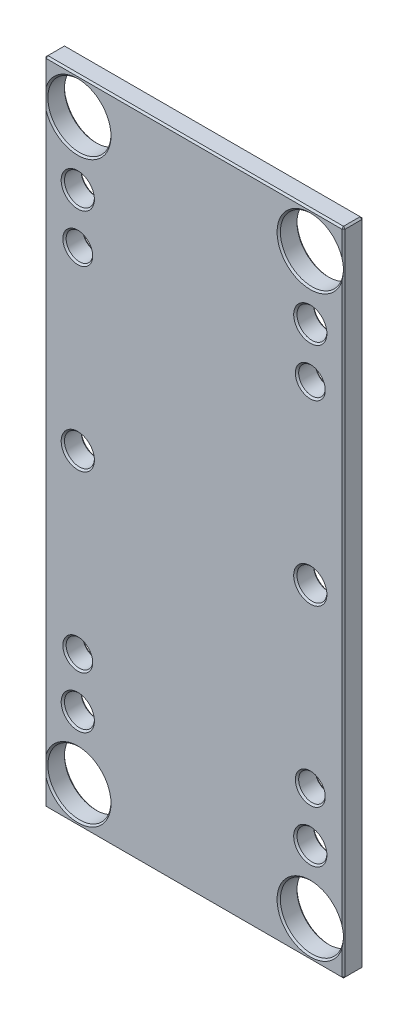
ISO-10303-21;
HEADER;
FILE_DESCRIPTION(('STEP AP214'),'2;1');
FILE_NAME('part.step','',(''),(''),'','','');
FILE_SCHEMA(('AUTOMOTIVE_DESIGN { 1 0 10303 214 1 1 1 1 }'));
ENDSEC;
DATA;
#1=APPLICATION_CONTEXT('core data for automotive mechanical design processes');
#2=APPLICATION_PROTOCOL_DEFINITION('international standard','automotive_design',2000,#1);
#3=PRODUCT_CONTEXT('',#1,'mechanical');
#4=PRODUCT('Part','Part','',(#3));
#5=PRODUCT_RELATED_PRODUCT_CATEGORY('part','',(#4));
#6=PRODUCT_DEFINITION_FORMATION('','',#4);
#7=PRODUCT_DEFINITION_CONTEXT('part definition',#1,'design');
#8=PRODUCT_DEFINITION('design','',#6,#7);
#9=PRODUCT_DEFINITION_SHAPE('','',#8);
#10=(LENGTH_UNIT() NAMED_UNIT(*) SI_UNIT(.MILLI.,.METRE.));
#11=(NAMED_UNIT(*) PLANE_ANGLE_UNIT() SI_UNIT($,.RADIAN.));
#12=(NAMED_UNIT(*) SI_UNIT($,.STERADIAN.) SOLID_ANGLE_UNIT());
#13=UNCERTAINTY_MEASURE_WITH_UNIT(LENGTH_MEASURE(1.E-05),#10,'distance_accuracy_value','');
#14=(GEOMETRIC_REPRESENTATION_CONTEXT(3) GLOBAL_UNCERTAINTY_ASSIGNED_CONTEXT((#13)) GLOBAL_UNIT_ASSIGNED_CONTEXT((#10,
#11,#12)) REPRESENTATION_CONTEXT('',''));
#15=CARTESIAN_POINT('',(0.,0.,0.));
#16=DIRECTION('',(0.,0.,1.));
#17=DIRECTION('',(1.,0.,0.));
#18=AXIS2_PLACEMENT_3D('',#15,#16,#17);
#19=CARTESIAN_POINT('',(89.75,0.250000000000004,5.5));
#20=DIRECTION('',(0.577350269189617,-0.577350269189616,0.577350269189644));
#21=DIRECTION('',(0.707106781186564,0.,-0.707106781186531));
#22=AXIS2_PLACEMENT_3D('',#19,#20,#21);
#23=PLANE('',#22);
#24=DIRECTION('',(0.,-0.707106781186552,-0.707106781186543));
#25=VECTOR('',#24,1.);
#26=CARTESIAN_POINT('',(89.5,0.250000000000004,5.75));
#27=LINE('',#26,#25);
#28=CARTESIAN_POINT('',(89.5,0.,5.5));
#29=VERTEX_POINT('',#28);
#30=CARTESIAN_POINT('',(89.5,0.500000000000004,6.));
#31=VERTEX_POINT('',#30);
#32=EDGE_CURVE('E158',#29,#31,#27,.F.);
#33=ORIENTED_EDGE('',*,*,#32,.F.);
#34=DIRECTION('',(0.707106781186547,0.707106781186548,0.));
#35=VECTOR('',#34,1.);
#36=CARTESIAN_POINT('',(89.75,0.250000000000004,5.5));
#37=LINE('',#36,#35);
#38=CARTESIAN_POINT('',(90.,0.499999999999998,5.5));
#39=VERTEX_POINT('',#38);
#40=EDGE_CURVE('E292',#39,#29,#37,.F.);
#41=ORIENTED_EDGE('',*,*,#40,.F.);
#42=DIRECTION('',(0.707106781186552,0.,-0.707106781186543));
#43=VECTOR('',#42,1.);
#44=CARTESIAN_POINT('',(89.75,0.5,5.75000000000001));
#45=LINE('',#44,#43);
#46=EDGE_CURVE('E273',#31,#39,#45,.T.);
#47=ORIENTED_EDGE('',*,*,#46,.F.);
#48=EDGE_LOOP('',(#33,#41,#47));
#49=FACE_BOUND('',#48,.T.);
#50=ADVANCED_FACE('F17',(#49),#23,.T.);
#51=CARTESIAN_POINT('',(89.75,195.75,5.5));
#52=DIRECTION('',(0.577350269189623,0.577350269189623,0.577350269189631));
#53=DIRECTION('',(0.,-0.707106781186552,0.707106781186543));
#54=AXIS2_PLACEMENT_3D('',#51,#52,#53);
#55=PLANE('',#54);
#56=DIRECTION('',(0.707106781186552,0.,-0.707106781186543));
#57=VECTOR('',#56,1.);
#58=CARTESIAN_POINT('',(89.75,195.5,5.75));
#59=LINE('',#58,#57);
#60=CARTESIAN_POINT('',(90.,195.5,5.5));
#61=VERTEX_POINT('',#60);
#62=CARTESIAN_POINT('',(89.5,195.5,6.00000000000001));
#63=VERTEX_POINT('',#62);
#64=EDGE_CURVE('E267',#61,#63,#59,.F.);
#65=ORIENTED_EDGE('',*,*,#64,.F.);
#66=DIRECTION('',(-0.707106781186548,0.707106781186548,0.));
#67=VECTOR('',#66,1.);
#68=CARTESIAN_POINT('',(89.75,195.75,5.5));
#69=LINE('',#68,#67);
#70=CARTESIAN_POINT('',(89.5,196.,5.5));
#71=VERTEX_POINT('',#70);
#72=EDGE_CURVE('E255',#71,#61,#69,.F.);
#73=ORIENTED_EDGE('',*,*,#72,.F.);
#74=DIRECTION('',(0.,-0.707106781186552,0.707106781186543));
#75=VECTOR('',#74,1.);
#76=CARTESIAN_POINT('',(89.5,195.75,5.75));
#77=LINE('',#76,#75);
#78=EDGE_CURVE('E244',#63,#71,#77,.F.);
#79=ORIENTED_EDGE('',*,*,#78,.F.);
#80=EDGE_LOOP('',(#65,#73,#79));
#81=FACE_BOUND('',#80,.T.);
#82=ADVANCED_FACE('F596',(#81),#55,.T.);
#83=CARTESIAN_POINT('',(0.250000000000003,0.249999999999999,5.5));
#84=DIRECTION('',(-0.577350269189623,-0.577350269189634,0.577350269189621));
#85=DIRECTION('',(0.707106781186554,-0.707106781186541,0.));
#86=AXIS2_PLACEMENT_3D('',#83,#84,#85);
#87=PLANE('',#86);
#88=DIRECTION('',(0.,-0.707106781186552,-0.707106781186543));
#89=VECTOR('',#88,1.);
#90=CARTESIAN_POINT('',(0.499999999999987,0.250000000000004,5.75));
#91=LINE('',#90,#89);
#92=CARTESIAN_POINT('',(0.49999999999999,0.500000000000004,6.));
#93=VERTEX_POINT('',#92);
#94=CARTESIAN_POINT('',(0.499999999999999,0.,5.5));
#95=VERTEX_POINT('',#94);
#96=EDGE_CURVE('E149',#93,#95,#91,.T.);
#97=ORIENTED_EDGE('',*,*,#96,.F.);
#98=DIRECTION('',(0.707106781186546,0.,0.707106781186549));
#99=VECTOR('',#98,1.);
#100=CARTESIAN_POINT('',(0.249999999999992,0.5,5.74999999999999));
#101=LINE('',#100,#99);
#102=CARTESIAN_POINT('',(0.,0.5,5.5));
#103=VERTEX_POINT('',#102);
#104=EDGE_CURVE('E176',#103,#93,#101,.T.);
#105=ORIENTED_EDGE('',*,*,#104,.F.);
#106=DIRECTION('',(0.707106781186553,-0.707106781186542,0.));
#107=VECTOR('',#106,1.);
#108=CARTESIAN_POINT('',(0.250000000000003,0.25,5.5));
#109=LINE('',#108,#107);
#110=EDGE_CURVE('E173',#95,#103,#109,.F.);
#111=ORIENTED_EDGE('',*,*,#110,.F.);
#112=EDGE_LOOP('',(#97,#105,#111));
#113=FACE_BOUND('',#112,.T.);
#114=ADVANCED_FACE('F174',(#113),#87,.T.);
#115=CARTESIAN_POINT('',(0.249999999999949,195.75,5.5));
#116=DIRECTION('',(-0.577350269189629,0.577350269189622,0.577350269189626));
#117=DIRECTION('',(0.707106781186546,0.,0.707106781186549));
#118=AXIS2_PLACEMENT_3D('',#115,#116,#117);
#119=PLANE('',#118);
#120=DIRECTION('',(0.707106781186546,0.,0.707106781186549));
#121=VECTOR('',#120,1.);
#122=CARTESIAN_POINT('',(0.249999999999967,195.5,5.75000000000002));
#123=LINE('',#122,#121);
#124=CARTESIAN_POINT('',(0.499999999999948,195.5,6.00000000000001));
#125=VERTEX_POINT('',#124);
#126=CARTESIAN_POINT('',(0.,195.5,5.5));
#127=VERTEX_POINT('',#126);
#128=EDGE_CURVE('E229',#125,#127,#123,.F.);
#129=ORIENTED_EDGE('',*,*,#128,.F.);
#130=DIRECTION('',(0.,-0.707106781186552,0.707106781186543));
#131=VECTOR('',#130,1.);
#132=CARTESIAN_POINT('',(0.499999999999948,195.75,5.75));
#133=LINE('',#132,#131);
#134=CARTESIAN_POINT('',(0.499999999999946,196.,5.5));
#135=VERTEX_POINT('',#134);
#136=EDGE_CURVE('E104',#135,#125,#133,.T.);
#137=ORIENTED_EDGE('',*,*,#136,.F.);
#138=DIRECTION('',(-0.707106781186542,-0.707106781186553,0.));
#139=VECTOR('',#138,1.);
#140=CARTESIAN_POINT('',(0.249999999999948,195.75,5.5));
#141=LINE('',#140,#139);
#142=EDGE_CURVE('E209',#127,#135,#141,.F.);
#143=ORIENTED_EDGE('',*,*,#142,.F.);
#144=EDGE_LOOP('',(#129,#137,#143));
#145=FACE_BOUND('',#144,.T.);
#146=ADVANCED_FACE('F590',(#145),#119,.T.);
#147=CARTESIAN_POINT('',(45.,98.,6.));
#148=DIRECTION('',(0.,0.,1.));
#149=DIRECTION('',(1.,0.,0.));
#150=AXIS2_PLACEMENT_3D('',#147,#148,#149);
#151=PLANE('',#150);
#152=CARTESIAN_POINT('',(10.,151.,6.00000000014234));
#153=DIRECTION('',(0.,0.,1.));
#154=DIRECTION('',(1.,0.,0.));
#155=AXIS2_PLACEMENT_3D('',#152,#153,#154);
#156=CIRCLE('',#155,4.49999999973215);
#157=CARTESIAN_POINT('',(14.4999999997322,151.,6.00000000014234));
#158=VERTEX_POINT('',#157);
#159=EDGE_CURVE('E202',#158,#158,#156,.F.);
#160=ORIENTED_EDGE('',*,*,#159,.T.);
#161=EDGE_LOOP('',(#160));
#162=FACE_BOUND('',#161,.T.);
#163=CARTESIAN_POINT('',(10.,45.,6.00000000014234));
#164=DIRECTION('',(0.,0.,1.));
#165=DIRECTION('',(1.,0.,0.));
#166=AXIS2_PLACEMENT_3D('',#163,#164,#165);
#167=CIRCLE('',#166,4.49999999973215);
#168=CARTESIAN_POINT('',(14.4999999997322,45.,6.00000000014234));
#169=VERTEX_POINT('',#168);
#170=EDGE_CURVE('E1349',#169,#169,#167,.F.);
#171=ORIENTED_EDGE('',*,*,#170,.T.);
#172=EDGE_LOOP('',(#171));
#173=FACE_BOUND('',#172,.T.);
#174=CARTESIAN_POINT('',(80.,151.,6.00000000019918));
#175=DIRECTION('',(0.,0.,1.));
#176=DIRECTION('',(1.,0.,0.));
#177=AXIS2_PLACEMENT_3D('',#174,#175,#176);
#178=CIRCLE('',#177,4.49999999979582);
#179=CARTESIAN_POINT('',(84.4999999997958,151.,6.00000000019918));
#180=VERTEX_POINT('',#179);
#181=EDGE_CURVE('E1353',#180,#180,#178,.F.);
#182=ORIENTED_EDGE('',*,*,#181,.T.);
#183=EDGE_LOOP('',(#182));
#184=FACE_BOUND('',#183,.T.);
#185=CARTESIAN_POINT('',(80.,30.,6.00000000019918));
#186=DIRECTION('',(0.,0.,1.));
#187=DIRECTION('',(1.,0.,0.));
#188=AXIS2_PLACEMENT_3D('',#185,#186,#187);
#189=CIRCLE('',#188,4.999999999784);
#190=CARTESIAN_POINT('',(84.999999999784,30.,6.00000000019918));
#191=VERTEX_POINT('',#190);
#192=EDGE_CURVE('E1357',#191,#191,#189,.F.);
#193=ORIENTED_EDGE('',*,*,#192,.T.);
#194=EDGE_LOOP('',(#193));
#195=FACE_BOUND('',#194,.T.);
#196=CARTESIAN_POINT('',(80.,166.,6.00000000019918));
#197=DIRECTION('',(0.,0.,1.));
#198=DIRECTION('',(1.,0.,0.));
#199=AXIS2_PLACEMENT_3D('',#196,#197,#198);
#200=CIRCLE('',#199,4.999999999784);
#201=CARTESIAN_POINT('',(84.999999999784,166.,6.00000000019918));
#202=VERTEX_POINT('',#201);
#203=EDGE_CURVE('E1361',#202,#202,#200,.F.);
#204=ORIENTED_EDGE('',*,*,#203,.T.);
#205=EDGE_LOOP('',(#204));
#206=FACE_BOUND('',#205,.T.);
#207=CARTESIAN_POINT('',(10.,98.,6.00000000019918));
#208=DIRECTION('',(0.,0.,1.));
#209=DIRECTION('',(1.,0.,0.));
#210=AXIS2_PLACEMENT_3D('',#207,#208,#209);
#211=CIRCLE('',#210,4.99999999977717);
#212=CARTESIAN_POINT('',(14.9999999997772,98.,6.00000000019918));
#213=VERTEX_POINT('',#212);
#214=EDGE_CURVE('E1365',#213,#213,#211,.F.);
#215=ORIENTED_EDGE('',*,*,#214,.T.);
#216=EDGE_LOOP('',(#215));
#217=FACE_BOUND('',#216,.T.);
#218=CARTESIAN_POINT('',(10.,30.,6.00000000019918));
#219=DIRECTION('',(0.,0.,1.));
#220=DIRECTION('',(1.,0.,0.));
#221=AXIS2_PLACEMENT_3D('',#218,#219,#220);
#222=CIRCLE('',#221,4.99999999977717);
#223=CARTESIAN_POINT('',(14.9999999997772,30.,6.00000000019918));
#224=VERTEX_POINT('',#223);
#225=EDGE_CURVE('E1369',#224,#224,#222,.F.);
#226=ORIENTED_EDGE('',*,*,#225,.T.);
#227=EDGE_LOOP('',(#226));
#228=FACE_BOUND('',#227,.T.);
#229=CARTESIAN_POINT('',(10.,166.,6.00000000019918));
#230=DIRECTION('',(0.,0.,1.));
#231=DIRECTION('',(1.,0.,0.));
#232=AXIS2_PLACEMENT_3D('',#229,#230,#231);
#233=CIRCLE('',#232,4.99999999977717);
#234=CARTESIAN_POINT('',(14.9999999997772,166.,6.00000000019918));
#235=VERTEX_POINT('',#234);
#236=EDGE_CURVE('E1373',#235,#235,#233,.F.);
#237=ORIENTED_EDGE('',*,*,#236,.T.);
#238=EDGE_LOOP('',(#237));
#239=FACE_BOUND('',#238,.T.);
#240=CARTESIAN_POINT('',(80.,98.,6.00000000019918));
#241=DIRECTION('',(0.,0.,1.));
#242=DIRECTION('',(1.,0.,0.));
#243=AXIS2_PLACEMENT_3D('',#240,#241,#242);
#244=CIRCLE('',#243,4.999999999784);
#245=CARTESIAN_POINT('',(84.999999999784,98.,6.00000000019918));
#246=VERTEX_POINT('',#245);
#247=EDGE_CURVE('E1377',#246,#246,#244,.F.);
#248=ORIENTED_EDGE('',*,*,#247,.T.);
#249=EDGE_LOOP('',(#248));
#250=FACE_BOUND('',#249,.T.);
#251=CARTESIAN_POINT('',(80.,45.,6.00000000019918));
#252=DIRECTION('',(0.,0.,1.));
#253=DIRECTION('',(1.,0.,0.));
#254=AXIS2_PLACEMENT_3D('',#251,#252,#253);
#255=CIRCLE('',#254,4.49999999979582);
#256=CARTESIAN_POINT('',(84.4999999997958,45.,6.00000000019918));
#257=VERTEX_POINT('',#256);
#258=EDGE_CURVE('E561',#257,#257,#255,.F.);
#259=ORIENTED_EDGE('',*,*,#258,.T.);
#260=EDGE_LOOP('',(#259));
#261=FACE_BOUND('',#260,.T.);
#262=CARTESIAN_POINT('',(80.,11.,6.00000000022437));
#263=DIRECTION('',(0.,0.,1.));
#264=DIRECTION('',(0.,-1.,0.));
#265=AXIS2_PLACEMENT_3D('',#262,#263,#264);
#266=CIRCLE('',#265,9.99999999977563);
#267=CARTESIAN_POINT('',(89.4999999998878,7.87750100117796,6.00000000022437));
#268=VERTEX_POINT('',#267);
#269=CARTESIAN_POINT('',(89.4999999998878,14.1224989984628,6.00000000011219));
#270=VERTEX_POINT('',#269);
#271=EDGE_CURVE('E313',#268,#270,#266,.F.);
#272=ORIENTED_EDGE('',*,*,#271,.T.);
#273=DIRECTION('',(0.,1.,0.));
#274=VECTOR('',#273,1.);
#275=CARTESIAN_POINT('',(89.5,147.,6.));
#276=LINE('',#275,#274);
#277=CARTESIAN_POINT('',(89.4999999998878,181.877501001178,6.00000000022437));
#278=VERTEX_POINT('',#277);
#279=EDGE_CURVE('E277',#278,#270,#276,.F.);
#280=ORIENTED_EDGE('',*,*,#279,.F.);
#281=CARTESIAN_POINT('',(80.,185.,6.00000000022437));
#282=DIRECTION('',(0.,0.,1.));
#283=DIRECTION('',(1.,0.,0.));
#284=AXIS2_PLACEMENT_3D('',#281,#282,#283);
#285=CIRCLE('',#284,9.99999999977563);
#286=CARTESIAN_POINT('',(89.4999999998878,188.122498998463,6.00000000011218));
#287=VERTEX_POINT('',#286);
#288=EDGE_CURVE('E296',#278,#287,#285,.F.);
#289=ORIENTED_EDGE('',*,*,#288,.T.);
#290=DIRECTION('',(0.,1.,0.));
#291=VECTOR('',#290,1.);
#292=CARTESIAN_POINT('',(89.5,147.,6.));
#293=LINE('',#292,#291);
#294=EDGE_CURVE('E259',#63,#287,#293,.F.);
#295=ORIENTED_EDGE('',*,*,#294,.F.);
#296=DIRECTION('',(1.,0.,0.));
#297=VECTOR('',#296,1.);
#298=CARTESIAN_POINT('',(22.5,195.5,6.00000000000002));
#299=LINE('',#298,#297);
#300=EDGE_CURVE('E182',#125,#63,#299,.T.);
#301=ORIENTED_EDGE('',*,*,#300,.F.);
#302=DIRECTION('',(0.,1.,0.));
#303=VECTOR('',#302,1.);
#304=CARTESIAN_POINT('',(0.499999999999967,49.,5.99999999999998));
#305=LINE('',#304,#303);
#306=CARTESIAN_POINT('',(0.500000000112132,188.122498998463,6.00000000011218));
#307=VERTEX_POINT('',#306);
#308=EDGE_CURVE('E226',#307,#125,#305,.T.);
#309=ORIENTED_EDGE('',*,*,#308,.F.);
#310=CARTESIAN_POINT('',(10.,185.,6.00000000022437));
#311=DIRECTION('',(0.,0.,1.));
#312=DIRECTION('',(0.,-1.,0.));
#313=AXIS2_PLACEMENT_3D('',#310,#311,#312);
#314=CIRCLE('',#313,9.99999999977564);
#315=CARTESIAN_POINT('',(0.500000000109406,181.877501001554,6.00000000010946));
#316=VERTEX_POINT('',#315);
#317=EDGE_CURVE('E208',#307,#316,#314,.F.);
#318=ORIENTED_EDGE('',*,*,#317,.T.);
#319=DIRECTION('',(0.,1.,0.));
#320=VECTOR('',#319,1.);
#321=CARTESIAN_POINT('',(0.49999999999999,49.,6.00000000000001));
#322=LINE('',#321,#320);
#323=CARTESIAN_POINT('',(0.500000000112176,14.122498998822,6.00000000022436));
#324=VERTEX_POINT('',#323);
#325=EDGE_CURVE('E230',#324,#316,#322,.T.);
#326=ORIENTED_EDGE('',*,*,#325,.F.);
#327=CARTESIAN_POINT('',(10.,11.,6.00000000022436));
#328=DIRECTION('',(0.,0.,1.));
#329=DIRECTION('',(1.,0.,0.));
#330=AXIS2_PLACEMENT_3D('',#327,#328,#329);
#331=CIRCLE('',#330,9.99999999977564);
#332=CARTESIAN_POINT('',(0.500000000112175,7.87750100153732,6.00000000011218));
#333=VERTEX_POINT('',#332);
#334=EDGE_CURVE('E20',#324,#333,#331,.F.);
#335=ORIENTED_EDGE('',*,*,#334,.T.);
#336=DIRECTION('',(0.,1.,0.));
#337=VECTOR('',#336,1.);
#338=CARTESIAN_POINT('',(0.499999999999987,49.,6.));
#339=LINE('',#338,#337);
#340=EDGE_CURVE('E213',#93,#333,#339,.T.);
#341=ORIENTED_EDGE('',*,*,#340,.F.);
#342=DIRECTION('',(1.,0.,0.));
#343=VECTOR('',#342,1.);
#344=CARTESIAN_POINT('',(67.5,0.500000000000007,6.));
#345=LINE('',#344,#343);
#346=EDGE_CURVE('E154',#31,#93,#345,.F.);
#347=ORIENTED_EDGE('',*,*,#346,.F.);
#348=DIRECTION('',(0.,1.,0.));
#349=VECTOR('',#348,1.);
#350=CARTESIAN_POINT('',(89.5,147.,5.99999999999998));
#351=LINE('',#350,#349);
#352=EDGE_CURVE('E270',#268,#31,#351,.F.);
#353=ORIENTED_EDGE('',*,*,#352,.F.);
#354=EDGE_LOOP('',(#272,#280,#289,#295,#301,#309,#318,#326,#335,#341,#347,#353));
#355=FACE_BOUND('',#354,.T.);
#356=ADVANCED_FACE('F587',(#162,#173,#184,#195,#206,#217,#228,#239,#250,#261,#355),#151,.T.);
#357=CARTESIAN_POINT('',(10.,11.,6.00000000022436));
#358=DIRECTION('',(0.,0.,1.));
#359=DIRECTION('',(1.,0.,0.));
#360=AXIS2_PLACEMENT_3D('',#357,#358,#359);
#361=CONICAL_SURFACE('',#360,9.99999999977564,0.785398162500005);
#362=ORIENTED_EDGE('',*,*,#334,.F.);
#363=CARTESIAN_POINT('',(0.500000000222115,7.87750100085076,6.00000000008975));
#364=CARTESIAN_POINT('',(0.468607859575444,8.07350515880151,5.9686078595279));
#365=CARTESIAN_POINT('',(0.440037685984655,8.27042005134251,5.94003768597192));
#366=CARTESIAN_POINT('',(0.388707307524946,8.66577609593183,5.88870730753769));
#367=CARTESIAN_POINT('',(0.365947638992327,8.86421738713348,5.86594763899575));
#368=CARTESIAN_POINT('',(0.326399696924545,9.26240008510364,5.82639969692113));
#369=CARTESIAN_POINT('',(0.309614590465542,9.46214212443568,5.80961459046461));
#370=CARTESIAN_POINT('',(0.282152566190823,9.86244422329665,5.78215256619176));
#371=CARTESIAN_POINT('',(0.271475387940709,10.0630042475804,5.77147538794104));
#372=CARTESIAN_POINT('',(0.249024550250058,10.6578729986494,5.74902455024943));
#373=CARTESIAN_POINT('',(0.246081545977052,11.0529180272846,5.74608154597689));
#374=CARTESIAN_POINT('',(0.264178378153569,11.8416623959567,5.76417837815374));
#375=CARTESIAN_POINT('',(0.285202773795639,12.2353624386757,5.78520277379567));
#376=CARTESIAN_POINT('',(0.32832551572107,12.752267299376,5.82832551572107));
#377=CARTESIAN_POINT('',(0.339969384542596,12.8773395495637,5.8399693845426));
#378=CARTESIAN_POINT('',(0.365602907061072,13.1269879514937,5.86560290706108));
#379=CARTESIAN_POINT('',(0.379592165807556,13.251564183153,5.87959216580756));
#380=CARTESIAN_POINT('',(0.409972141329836,13.50091059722,5.90997214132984));
#381=CARTESIAN_POINT('',(0.426377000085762,13.625677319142,5.92637700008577));
#382=CARTESIAN_POINT('',(0.461480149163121,13.8745824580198,5.96148014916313));
#383=CARTESIAN_POINT('',(0.480178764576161,13.9987207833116,5.98017876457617));
#384=CARTESIAN_POINT('',(0.500000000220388,14.1224989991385,6.0000000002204));
#385=B_SPLINE_CURVE_WITH_KNOTS('',3,(#363,#364,#365,#366,#367,#368,#369,#370,#371,#372,#373,
#374,#375,#376,#377,#378,#379,#380,#381,#382,#383,#384),.UNSPECIFIED.,.F.,.F.,(4,2,2,2,2,2,2,2,
2,2,4),(0.,0.602874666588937,1.20580496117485,1.80905439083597,2.41227809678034,
3.59593760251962,4.77883497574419,5.15726204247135,5.53562544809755,5.91629918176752,
6.29702693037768),.UNSPECIFIED.);
#386=EDGE_CURVE('E181',#333,#324,#385,.T.);
#387=ORIENTED_EDGE('',*,*,#386,.F.);
#388=EDGE_LOOP('',(#362,#387));
#389=FACE_BOUND('',#388,.T.);
#390=CARTESIAN_POINT('',(10.,11.,5.50000000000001));
#391=DIRECTION('',(0.,0.,-1.));
#392=DIRECTION('',(-1.,0.,0.));
#393=AXIS2_PLACEMENT_3D('',#390,#391,#392);
#394=CIRCLE('',#393,9.5);
#395=CARTESIAN_POINT('',(0.5,11.,5.50000000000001));
#396=VERTEX_POINT('',#395);
#397=EDGE_CURVE('E170',#396,#396,#394,.T.);
#398=ORIENTED_EDGE('',*,*,#397,.T.);
#399=EDGE_LOOP('',(#398));
#400=FACE_BOUND('',#399,.T.);
#401=ADVANCED_FACE('F582',(#389,#400),#361,.F.);
#402=CARTESIAN_POINT('',(67.5,0.250000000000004,5.75));
#403=DIRECTION('',(0.,-0.707106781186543,0.707106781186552));
#404=DIRECTION('',(0.,-0.707106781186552,-0.707106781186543));
#405=AXIS2_PLACEMENT_3D('',#402,#403,#404);
#406=PLANE('',#405);
#407=ORIENTED_EDGE('',*,*,#32,.T.);
#408=ORIENTED_EDGE('',*,*,#346,.T.);
#409=ORIENTED_EDGE('',*,*,#96,.T.);
#410=DIRECTION('',(1.,0.,0.));
#411=VECTOR('',#410,1.);
#412=CARTESIAN_POINT('',(90.,0.,5.5));
#413=LINE('',#412,#411);
#414=EDGE_CURVE('E152',#29,#95,#413,.F.);
#415=ORIENTED_EDGE('',*,*,#414,.F.);
#416=EDGE_LOOP('',(#407,#408,#409,#415));
#417=FACE_BOUND('',#416,.T.);
#418=ADVANCED_FACE('F151',(#417),#406,.T.);
#419=CARTESIAN_POINT('',(80.,11.,6.00000000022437));
#420=DIRECTION('',(0.,0.,1.));
#421=DIRECTION('',(0.,-1.,0.));
#422=AXIS2_PLACEMENT_3D('',#419,#420,#421);
#423=CONICAL_SURFACE('',#422,9.99999999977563,0.785398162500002);
#424=ORIENTED_EDGE('',*,*,#271,.F.);
#425=CARTESIAN_POINT('',(89.4999999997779,14.1224989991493,6.00000000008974));
#426=CARTESIAN_POINT('',(89.5313921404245,13.9264948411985,5.9686078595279));
#427=CARTESIAN_POINT('',(89.5599623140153,13.7295799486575,5.94003768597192));
#428=CARTESIAN_POINT('',(89.611292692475,13.3342239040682,5.88870730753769));
#429=CARTESIAN_POINT('',(89.6340523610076,13.1357826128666,5.86594763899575));
#430=CARTESIAN_POINT('',(89.6736003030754,12.7375999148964,5.82639969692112));
#431=CARTESIAN_POINT('',(89.6903854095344,12.5378578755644,5.8096145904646));
#432=CARTESIAN_POINT('',(89.7178474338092,12.1375557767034,5.78215256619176));
#433=CARTESIAN_POINT('',(89.7285246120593,11.9369957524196,5.77147538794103));
#434=CARTESIAN_POINT('',(89.7509754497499,11.3421270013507,5.74902455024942));
#435=CARTESIAN_POINT('',(89.753918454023,10.9470819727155,5.74608154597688));
#436=CARTESIAN_POINT('',(89.7358216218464,10.1583376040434,5.76417837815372));
#437=CARTESIAN_POINT('',(89.7147972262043,9.76463756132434,5.78520277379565));
#438=CARTESIAN_POINT('',(89.6716744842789,9.24773270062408,5.82832551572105));
#439=CARTESIAN_POINT('',(89.6600306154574,9.12266045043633,5.83996938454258));
#440=CARTESIAN_POINT('',(89.6343970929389,8.87301204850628,5.86560290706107));
#441=CARTESIAN_POINT('',(89.6204078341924,8.74843581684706,5.87959216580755));
#442=CARTESIAN_POINT('',(89.5900278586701,8.49908940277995,5.90997214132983));
#443=CARTESIAN_POINT('',(89.5736229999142,8.37432268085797,5.92637700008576));
#444=CARTESIAN_POINT('',(89.5385198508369,8.12541754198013,5.96148014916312));
#445=CARTESIAN_POINT('',(89.5198212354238,8.00127921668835,5.98017876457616));
#446=CARTESIAN_POINT('',(89.4999999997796,7.87750100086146,6.00000000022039));
#447=B_SPLINE_CURVE_WITH_KNOTS('',3,(#425,#426,#427,#428,#429,#430,#431,#432,#433,#434,#435,
#436,#437,#438,#439,#440,#441,#442,#443,#444,#445,#446),.UNSPECIFIED.,.F.,.F.,(4,2,2,2,2,2,2,2,
2,2,4),(0.,0.602874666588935,1.20580496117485,1.80905439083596,2.41227809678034,
3.59593760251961,4.77883497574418,5.15726204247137,5.53562544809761,5.91629918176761,
6.2970269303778),.UNSPECIFIED.);
#448=EDGE_CURVE('E274',#270,#268,#447,.T.);
#449=ORIENTED_EDGE('',*,*,#448,.F.);
#450=EDGE_LOOP('',(#424,#449));
#451=FACE_BOUND('',#450,.T.);
#452=CARTESIAN_POINT('',(80.,11.,5.50000000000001));
#453=DIRECTION('',(0.,0.,-1.));
#454=DIRECTION('',(-1.,0.,0.));
#455=AXIS2_PLACEMENT_3D('',#452,#453,#454);
#456=CIRCLE('',#455,9.5);
#457=CARTESIAN_POINT('',(70.5,11.,5.50000000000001));
#458=VERTEX_POINT('',#457);
#459=EDGE_CURVE('E190',#458,#458,#456,.T.);
#460=ORIENTED_EDGE('',*,*,#459,.T.);
#461=EDGE_LOOP('',(#460));
#462=FACE_BOUND('',#461,.T.);
#463=ADVANCED_FACE('F987',(#451,#462),#423,.F.);
#464=CARTESIAN_POINT('',(80.,185.,6.00000000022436));
#465=DIRECTION('',(0.,0.,1.));
#466=DIRECTION('',(1.,0.,0.));
#467=AXIS2_PLACEMENT_3D('',#464,#465,#466);
#468=CONICAL_SURFACE('',#467,9.99999999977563,0.785398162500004);
#469=ORIENTED_EDGE('',*,*,#288,.F.);
#470=CARTESIAN_POINT('',(89.4999999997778,188.122498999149,6.00000000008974));
#471=CARTESIAN_POINT('',(89.5313921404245,187.926494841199,5.9686078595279));
#472=CARTESIAN_POINT('',(89.5599623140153,187.729579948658,5.94003768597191));
#473=CARTESIAN_POINT('',(89.611292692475,187.334223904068,5.88870730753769));
#474=CARTESIAN_POINT('',(89.6340523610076,187.135782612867,5.86594763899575));
#475=CARTESIAN_POINT('',(89.6736003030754,186.737599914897,5.82639969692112));
#476=CARTESIAN_POINT('',(89.6903854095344,186.537857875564,5.8096145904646));
#477=CARTESIAN_POINT('',(89.7178474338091,186.137555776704,5.78215256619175));
#478=CARTESIAN_POINT('',(89.7285246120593,185.93699575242,5.77147538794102));
#479=CARTESIAN_POINT('',(89.7509754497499,185.342127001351,5.7490245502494));
#480=CARTESIAN_POINT('',(89.7539184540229,184.947081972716,5.74608154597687));
#481=CARTESIAN_POINT('',(89.7358216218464,184.158337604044,5.7641783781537));
#482=CARTESIAN_POINT('',(89.7147972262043,183.764637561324,5.78520277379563));
#483=CARTESIAN_POINT('',(89.6716744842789,183.247732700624,5.82832551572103));
#484=CARTESIAN_POINT('',(89.6600306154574,183.122660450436,5.83996938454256));
#485=CARTESIAN_POINT('',(89.6343970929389,182.873012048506,5.86560290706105));
#486=CARTESIAN_POINT('',(89.6204078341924,182.748435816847,5.87959216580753));
#487=CARTESIAN_POINT('',(89.5900278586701,182.49908940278,5.90997214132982));
#488=CARTESIAN_POINT('',(89.5736229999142,182.374322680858,5.92637700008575));
#489=CARTESIAN_POINT('',(89.5385198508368,182.12541754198,5.96148014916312));
#490=CARTESIAN_POINT('',(89.5198212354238,182.001279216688,5.98017876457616));
#491=CARTESIAN_POINT('',(89.4999999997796,181.877501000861,6.00000000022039));
#492=B_SPLINE_CURVE_WITH_KNOTS('',3,(#470,#471,#472,#473,#474,#475,#476,#477,#478,#479,#480,
#481,#482,#483,#484,#485,#486,#487,#488,#489,#490,#491),.UNSPECIFIED.,.F.,.F.,(4,2,2,2,2,2,2,2,
2,2,4),(0.,0.602874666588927,1.20580496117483,1.80905439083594,2.41227809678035,3.5959376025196,
4.77883497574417,5.15726204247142,5.53562544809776,5.91629918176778,6.297026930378),.UNSPECIFIED.);
#493=EDGE_CURVE('E279',#287,#278,#492,.T.);
#494=ORIENTED_EDGE('',*,*,#493,.F.);
#495=EDGE_LOOP('',(#469,#494));
#496=FACE_BOUND('',#495,.T.);
#497=CARTESIAN_POINT('',(80.,185.,5.50000000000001));
#498=DIRECTION('',(0.,0.,-1.));
#499=DIRECTION('',(-1.,0.,0.));
#500=AXIS2_PLACEMENT_3D('',#497,#498,#499);
#501=CIRCLE('',#500,9.5);
#502=CARTESIAN_POINT('',(70.5,185.,5.50000000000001));
#503=VERTEX_POINT('',#502);
#504=EDGE_CURVE('E828',#503,#503,#501,.T.);
#505=ORIENTED_EDGE('',*,*,#504,.T.);
#506=EDGE_LOOP('',(#505));
#507=FACE_BOUND('',#506,.T.);
#508=ADVANCED_FACE('F989',(#496,#507),#468,.F.);
#509=CARTESIAN_POINT('',(89.75,0.250000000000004,0.));
#510=DIRECTION('',(0.707106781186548,-0.707106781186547,0.));
#511=DIRECTION('',(0.707106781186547,0.707106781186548,0.));
#512=AXIS2_PLACEMENT_3D('',#509,#510,#511);
#513=PLANE('',#512);
#514=DIRECTION('',(0.707106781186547,0.707106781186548,0.));
#515=VECTOR('',#514,1.);
#516=CARTESIAN_POINT('',(89.75,0.250000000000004,0.5));
#517=LINE('',#516,#515);
#518=CARTESIAN_POINT('',(89.5,0.,0.5));
#519=VERTEX_POINT('',#518);
#520=CARTESIAN_POINT('',(90.,0.500000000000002,0.499999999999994));
#521=VERTEX_POINT('',#520);
#522=EDGE_CURVE('E290',#519,#521,#517,.T.);
#523=ORIENTED_EDGE('',*,*,#522,.T.);
#524=DIRECTION('',(0.,0.,-1.));
#525=VECTOR('',#524,1.);
#526=CARTESIAN_POINT('',(90.,0.5,0.));
#527=LINE('',#526,#525);
#528=EDGE_CURVE('E825',#39,#521,#527,.T.);
#529=ORIENTED_EDGE('',*,*,#528,.F.);
#530=ORIENTED_EDGE('',*,*,#40,.T.);
#531=DIRECTION('',(0.,0.,-1.));
#532=VECTOR('',#531,1.);
#533=CARTESIAN_POINT('',(89.5,0.,0.));
#534=LINE('',#533,#532);
#535=EDGE_CURVE('E169',#519,#29,#534,.F.);
#536=ORIENTED_EDGE('',*,*,#535,.F.);
#537=EDGE_LOOP('',(#523,#529,#530,#536));
#538=FACE_BOUND('',#537,.T.);
#539=ADVANCED_FACE('F995',(#538),#513,.T.);
#540=CARTESIAN_POINT('',(89.75,147.,5.75));
#541=DIRECTION('',(0.707106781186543,0.,0.707106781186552));
#542=DIRECTION('',(0.707106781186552,0.,-0.707106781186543));
#543=AXIS2_PLACEMENT_3D('',#540,#541,#542);
#544=PLANE('',#543);
#545=ORIENTED_EDGE('',*,*,#64,.T.);
#546=ORIENTED_EDGE('',*,*,#294,.T.);
#547=ORIENTED_EDGE('',*,*,#493,.T.);
#548=ORIENTED_EDGE('',*,*,#279,.T.);
#549=ORIENTED_EDGE('',*,*,#448,.T.);
#550=ORIENTED_EDGE('',*,*,#352,.T.);
#551=ORIENTED_EDGE('',*,*,#46,.T.);
#552=DIRECTION('',(0.,1.,0.));
#553=VECTOR('',#552,1.);
#554=CARTESIAN_POINT('',(90.,196.,5.5));
#555=LINE('',#554,#553);
#556=EDGE_CURVE('E283',#61,#39,#555,.F.);
#557=ORIENTED_EDGE('',*,*,#556,.F.);
#558=EDGE_LOOP('',(#545,#546,#547,#548,#549,#550,#551,#557));
#559=FACE_BOUND('',#558,.T.);
#560=ADVANCED_FACE('F1006',(#559),#544,.T.);
#561=CARTESIAN_POINT('',(89.75,195.75,0.));
#562=DIRECTION('',(0.707106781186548,0.707106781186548,0.));
#563=DIRECTION('',(-0.707106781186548,0.707106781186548,0.));
#564=AXIS2_PLACEMENT_3D('',#561,#562,#563);
#565=PLANE('',#564);
#566=DIRECTION('',(-0.707106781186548,0.707106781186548,0.));
#567=VECTOR('',#566,1.);
#568=CARTESIAN_POINT('',(89.75,195.75,0.5));
#569=LINE('',#568,#567);
#570=CARTESIAN_POINT('',(90.,195.5,0.500000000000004));
#571=VERTEX_POINT('',#570);
#572=CARTESIAN_POINT('',(89.5,196.,0.499999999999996));
#573=VERTEX_POINT('',#572);
#574=EDGE_CURVE('E253',#571,#573,#569,.T.);
#575=ORIENTED_EDGE('',*,*,#574,.T.);
#576=DIRECTION('',(0.,0.,1.));
#577=VECTOR('',#576,1.);
#578=CARTESIAN_POINT('',(89.5,196.,0.));
#579=LINE('',#578,#577);
#580=EDGE_CURVE('E286',#71,#573,#579,.F.);
#581=ORIENTED_EDGE('',*,*,#580,.F.);
#582=ORIENTED_EDGE('',*,*,#72,.T.);
#583=DIRECTION('',(0.,0.,-1.));
#584=VECTOR('',#583,1.);
#585=CARTESIAN_POINT('',(90.,195.5,0.));
#586=LINE('',#585,#584);
#587=EDGE_CURVE('E287',#571,#61,#586,.F.);
#588=ORIENTED_EDGE('',*,*,#587,.F.);
#589=EDGE_LOOP('',(#575,#581,#582,#588));
#590=FACE_BOUND('',#589,.T.);
#591=ADVANCED_FACE('F1010',(#590),#565,.T.);
#592=CARTESIAN_POINT('',(22.5,195.75,5.75));
#593=DIRECTION('',(0.,0.707106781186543,0.707106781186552));
#594=DIRECTION('',(0.,-0.707106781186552,0.707106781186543));
#595=AXIS2_PLACEMENT_3D('',#592,#593,#594);
#596=PLANE('',#595);
#597=ORIENTED_EDGE('',*,*,#136,.T.);
#598=ORIENTED_EDGE('',*,*,#300,.T.);
#599=ORIENTED_EDGE('',*,*,#78,.T.);
#600=DIRECTION('',(1.,0.,0.));
#601=VECTOR('',#600,1.);
#602=CARTESIAN_POINT('',(0.,196.,5.5));
#603=LINE('',#602,#601);
#604=EDGE_CURVE('E247',#135,#71,#603,.T.);
#605=ORIENTED_EDGE('',*,*,#604,.F.);
#606=EDGE_LOOP('',(#597,#598,#599,#605));
#607=FACE_BOUND('',#606,.T.);
#608=ADVANCED_FACE('F1014',(#607),#596,.T.);
#609=CARTESIAN_POINT('',(0.250000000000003,0.25,0.));
#610=DIRECTION('',(-0.707106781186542,-0.707106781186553,0.));
#611=DIRECTION('',(0.707106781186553,-0.707106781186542,0.));
#612=AXIS2_PLACEMENT_3D('',#609,#610,#611);
#613=PLANE('',#612);
#614=DIRECTION('',(-0.707106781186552,0.707106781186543,0.));
#615=VECTOR('',#614,1.);
#616=CARTESIAN_POINT('',(0.500000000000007,0.,0.5));
#617=LINE('',#616,#615);
#618=CARTESIAN_POINT('',(0.5,0.,0.5));
#619=VERTEX_POINT('',#618);
#620=CARTESIAN_POINT('',(0.,0.500000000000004,0.5));
#621=VERTEX_POINT('',#620);
#622=EDGE_CURVE('E187',#619,#621,#617,.T.);
#623=ORIENTED_EDGE('',*,*,#622,.F.);
#624=DIRECTION('',(0.,0.,-1.));
#625=VECTOR('',#624,1.);
#626=CARTESIAN_POINT('',(0.5,0.,0.));
#627=LINE('',#626,#625);
#628=EDGE_CURVE('E166',#95,#619,#627,.T.);
#629=ORIENTED_EDGE('',*,*,#628,.F.);
#630=ORIENTED_EDGE('',*,*,#110,.T.);
#631=DIRECTION('',(0.,0.,1.));
#632=VECTOR('',#631,1.);
#633=CARTESIAN_POINT('',(0.,0.5,0.));
#634=LINE('',#633,#632);
#635=EDGE_CURVE('E220',#621,#103,#634,.T.);
#636=ORIENTED_EDGE('',*,*,#635,.F.);
#637=EDGE_LOOP('',(#623,#629,#630,#636));
#638=FACE_BOUND('',#637,.T.);
#639=ADVANCED_FACE('F185',(#638),#613,.T.);
#640=CARTESIAN_POINT('',(0.249999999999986,49.,5.75));
#641=DIRECTION('',(-0.707106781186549,0.,0.707106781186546));
#642=DIRECTION('',(0.707106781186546,0.,0.707106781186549));
#643=AXIS2_PLACEMENT_3D('',#640,#641,#642);
#644=PLANE('',#643);
#645=ORIENTED_EDGE('',*,*,#104,.T.);
#646=ORIENTED_EDGE('',*,*,#340,.T.);
#647=ORIENTED_EDGE('',*,*,#386,.T.);
#648=ORIENTED_EDGE('',*,*,#325,.T.);
#649=CARTESIAN_POINT('',(0.500000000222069,181.877501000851,6.00000000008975));
#650=CARTESIAN_POINT('',(0.468607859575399,182.073505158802,5.9686078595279));
#651=CARTESIAN_POINT('',(0.440037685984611,182.270420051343,5.94003768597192));
#652=CARTESIAN_POINT('',(0.388707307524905,182.665776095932,5.8887073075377));
#653=CARTESIAN_POINT('',(0.365947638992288,182.864217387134,5.86594763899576));
#654=CARTESIAN_POINT('',(0.326399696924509,183.262400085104,5.82639969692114));
#655=CARTESIAN_POINT('',(0.309614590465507,183.462142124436,5.80961459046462));
#656=CARTESIAN_POINT('',(0.28215256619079,183.862444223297,5.78215256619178));
#657=CARTESIAN_POINT('',(0.271475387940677,184.063004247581,5.77147538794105));
#658=CARTESIAN_POINT('',(0.249024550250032,184.65787299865,5.74902455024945));
#659=CARTESIAN_POINT('',(0.24608154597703,185.052918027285,5.74608154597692));
#660=CARTESIAN_POINT('',(0.264178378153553,185.841662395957,5.76417837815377));
#661=CARTESIAN_POINT('',(0.285202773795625,186.235362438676,5.7852027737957));
#662=CARTESIAN_POINT('',(0.32832551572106,186.752267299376,5.8283255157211));
#663=CARTESIAN_POINT('',(0.339969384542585,186.877339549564,5.83996938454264));
#664=CARTESIAN_POINT('',(0.365602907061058,187.126987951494,5.86560290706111));
#665=CARTESIAN_POINT('',(0.379592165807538,187.251564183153,5.87959216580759));
#666=CARTESIAN_POINT('',(0.409972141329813,187.50091059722,5.90997214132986));
#667=CARTESIAN_POINT('',(0.426377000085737,187.625677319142,5.92637700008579));
#668=CARTESIAN_POINT('',(0.461480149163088,187.87458245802,5.96148014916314));
#669=CARTESIAN_POINT('',(0.480178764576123,187.998720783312,5.98017876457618));
#670=CARTESIAN_POINT('',(0.500000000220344,188.122498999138,6.0000000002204));
#671=B_SPLINE_CURVE_WITH_KNOTS('',3,(#649,#650,#651,#652,#653,#654,#655,#656,#657,#658,#659,
#660,#661,#662,#663,#664,#665,#666,#667,#668,#669,#670),.UNSPECIFIED.,.F.,.F.,(4,2,2,2,2,2,2,2,
2,2,4),(0.,0.602874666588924,1.20580496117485,1.80905439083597,2.41227809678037,
3.59593760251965,4.77883497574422,5.15726204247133,5.53562544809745,5.91629918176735,
6.2970269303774),.UNSPECIFIED.);
#672=EDGE_CURVE('E554',#316,#307,#671,.T.);
#673=ORIENTED_EDGE('',*,*,#672,.T.);
#674=ORIENTED_EDGE('',*,*,#308,.T.);
#675=ORIENTED_EDGE('',*,*,#128,.T.);
#676=DIRECTION('',(0.,1.,0.));
#677=VECTOR('',#676,1.);
#678=CARTESIAN_POINT('',(0.,0.,5.5));
#679=LINE('',#678,#677);
#680=EDGE_CURVE('E216',#103,#127,#679,.T.);
#681=ORIENTED_EDGE('',*,*,#680,.F.);
#682=EDGE_LOOP('',(#645,#646,#647,#648,#673,#674,#675,#681));
#683=FACE_BOUND('',#682,.T.);
#684=ADVANCED_FACE('F564',(#683),#644,.T.);
#685=CARTESIAN_POINT('',(0.249999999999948,195.75,0.));
#686=DIRECTION('',(-0.707106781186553,0.707106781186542,0.));
#687=DIRECTION('',(-0.707106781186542,-0.707106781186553,0.));
#688=AXIS2_PLACEMENT_3D('',#685,#686,#687);
#689=PLANE('',#688);
#690=DIRECTION('',(-0.707106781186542,-0.707106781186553,0.));
#691=VECTOR('',#690,1.);
#692=CARTESIAN_POINT('',(0.249999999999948,195.75,0.5));
#693=LINE('',#692,#691);
#694=CARTESIAN_POINT('',(0.499999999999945,196.,0.499999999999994));
#695=VERTEX_POINT('',#694);
#696=CARTESIAN_POINT('',(0.,195.5,0.499999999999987));
#697=VERTEX_POINT('',#696);
#698=EDGE_CURVE('E205',#695,#697,#693,.T.);
#699=ORIENTED_EDGE('',*,*,#698,.T.);
#700=DIRECTION('',(0.,0.,1.));
#701=VECTOR('',#700,1.);
#702=CARTESIAN_POINT('',(0.,195.5,0.));
#703=LINE('',#702,#701);
#704=EDGE_CURVE('E219',#127,#697,#703,.F.);
#705=ORIENTED_EDGE('',*,*,#704,.F.);
#706=ORIENTED_EDGE('',*,*,#142,.T.);
#707=DIRECTION('',(0.,0.,1.));
#708=VECTOR('',#707,1.);
#709=CARTESIAN_POINT('',(0.499999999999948,196.,0.));
#710=LINE('',#709,#708);
#711=EDGE_CURVE('E250',#695,#135,#710,.T.);
#712=ORIENTED_EDGE('',*,*,#711,.F.);
#713=EDGE_LOOP('',(#699,#705,#706,#712));
#714=FACE_BOUND('',#713,.T.);
#715=ADVANCED_FACE('F550',(#714),#689,.T.);
#716=CARTESIAN_POINT('',(10.,185.,6.00000000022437));
#717=DIRECTION('',(0.,0.,1.));
#718=DIRECTION('',(0.,-1.,0.));
#719=AXIS2_PLACEMENT_3D('',#716,#717,#718);
#720=CONICAL_SURFACE('',#719,9.99999999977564,0.785398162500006);
#721=ORIENTED_EDGE('',*,*,#317,.F.);
#722=ORIENTED_EDGE('',*,*,#672,.F.);
#723=EDGE_LOOP('',(#721,#722));
#724=FACE_BOUND('',#723,.T.);
#725=CARTESIAN_POINT('',(10.,185.,5.50000000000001));
#726=DIRECTION('',(0.,0.,-1.));
#727=DIRECTION('',(-1.,0.,0.));
#728=AXIS2_PLACEMENT_3D('',#725,#726,#727);
#729=CIRCLE('',#728,9.5);
#730=CARTESIAN_POINT('',(0.5,185.,5.50000000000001));
#731=VERTEX_POINT('',#730);
#732=EDGE_CURVE('E788',#731,#731,#729,.T.);
#733=ORIENTED_EDGE('',*,*,#732,.T.);
#734=EDGE_LOOP('',(#733));
#735=FACE_BOUND('',#734,.T.);
#736=ADVANCED_FACE('F545',(#724,#735),#720,.F.);
#737=CARTESIAN_POINT('',(80.,45.,6.00000000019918));
#738=DIRECTION('',(0.,0.,1.));
#739=DIRECTION('',(1.,0.,0.));
#740=AXIS2_PLACEMENT_3D('',#737,#738,#739);
#741=CONICAL_SURFACE('',#740,4.49999999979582,0.785398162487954);
#742=ORIENTED_EDGE('',*,*,#258,.F.);
#743=EDGE_LOOP('',(#742));
#744=FACE_BOUND('',#743,.T.);
#745=CARTESIAN_POINT('',(80.,45.,5.50000000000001));
#746=DIRECTION('',(0.,0.,-1.));
#747=DIRECTION('',(-1.,0.,0.));
#748=AXIS2_PLACEMENT_3D('',#745,#746,#747);
#749=CIRCLE('',#748,4.);
#750=CARTESIAN_POINT('',(76.,45.,5.50000000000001));
#751=VERTEX_POINT('',#750);
#752=EDGE_CURVE('E783',#751,#751,#749,.T.);
#753=ORIENTED_EDGE('',*,*,#752,.T.);
#754=EDGE_LOOP('',(#753));
#755=FACE_BOUND('',#754,.T.);
#756=ADVANCED_FACE('F541',(#744,#755),#741,.F.);
#757=CARTESIAN_POINT('',(80.,98.,6.00000000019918));
#758=DIRECTION('',(0.,0.,1.));
#759=DIRECTION('',(1.,0.,0.));
#760=AXIS2_PLACEMENT_3D('',#757,#758,#759);
#761=CONICAL_SURFACE('',#760,4.999999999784,0.785398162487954);
#762=ORIENTED_EDGE('',*,*,#247,.F.);
#763=EDGE_LOOP('',(#762));
#764=FACE_BOUND('',#763,.T.);
#765=CARTESIAN_POINT('',(80.,98.,5.50000000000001));
#766=DIRECTION('',(0.,0.,-1.));
#767=DIRECTION('',(-1.,0.,0.));
#768=AXIS2_PLACEMENT_3D('',#765,#766,#767);
#769=CIRCLE('',#768,4.5);
#770=CARTESIAN_POINT('',(75.5,98.,5.50000000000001));
#771=VERTEX_POINT('',#770);
#772=EDGE_CURVE('E778',#771,#771,#769,.T.);
#773=ORIENTED_EDGE('',*,*,#772,.T.);
#774=EDGE_LOOP('',(#773));
#775=FACE_BOUND('',#774,.T.);
#776=ADVANCED_FACE('F537',(#764,#775),#761,.F.);
#777=CARTESIAN_POINT('',(10.,166.,6.00000000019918));
#778=DIRECTION('',(0.,0.,1.));
#779=DIRECTION('',(1.,0.,0.));
#780=AXIS2_PLACEMENT_3D('',#777,#778,#779);
#781=CONICAL_SURFACE('',#780,4.99999999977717,0.78539816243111);
#782=ORIENTED_EDGE('',*,*,#236,.F.);
#783=EDGE_LOOP('',(#782));
#784=FACE_BOUND('',#783,.T.);
#785=CARTESIAN_POINT('',(10.,166.,5.50000000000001));
#786=DIRECTION('',(0.,0.,-1.));
#787=DIRECTION('',(-1.,0.,0.));
#788=AXIS2_PLACEMENT_3D('',#785,#786,#787);
#789=CIRCLE('',#788,4.5);
#790=CARTESIAN_POINT('',(5.5,166.,5.50000000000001));
#791=VERTEX_POINT('',#790);
#792=EDGE_CURVE('E773',#791,#791,#789,.T.);
#793=ORIENTED_EDGE('',*,*,#792,.T.);
#794=EDGE_LOOP('',(#793));
#795=FACE_BOUND('',#794,.T.);
#796=ADVANCED_FACE('F533',(#784,#795),#781,.F.);
#797=CARTESIAN_POINT('',(10.,30.,6.00000000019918));
#798=DIRECTION('',(0.,0.,1.));
#799=DIRECTION('',(1.,0.,0.));
#800=AXIS2_PLACEMENT_3D('',#797,#798,#799);
#801=CONICAL_SURFACE('',#800,4.99999999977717,0.78539816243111);
#802=ORIENTED_EDGE('',*,*,#225,.F.);
#803=EDGE_LOOP('',(#802));
#804=FACE_BOUND('',#803,.T.);
#805=CARTESIAN_POINT('',(10.,30.,5.50000000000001));
#806=DIRECTION('',(0.,0.,-1.));
#807=DIRECTION('',(-1.,0.,0.));
#808=AXIS2_PLACEMENT_3D('',#805,#806,#807);
#809=CIRCLE('',#808,4.5);
#810=CARTESIAN_POINT('',(5.5,30.,5.50000000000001));
#811=VERTEX_POINT('',#810);
#812=EDGE_CURVE('E768',#811,#811,#809,.T.);
#813=ORIENTED_EDGE('',*,*,#812,.T.);
#814=EDGE_LOOP('',(#813));
#815=FACE_BOUND('',#814,.T.);
#816=ADVANCED_FACE('F529',(#804,#815),#801,.F.);
#817=CARTESIAN_POINT('',(10.,98.,6.00000000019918));
#818=DIRECTION('',(0.,0.,1.));
#819=DIRECTION('',(1.,0.,0.));
#820=AXIS2_PLACEMENT_3D('',#817,#818,#819);
#821=CONICAL_SURFACE('',#820,4.99999999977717,0.78539816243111);
#822=ORIENTED_EDGE('',*,*,#214,.F.);
#823=EDGE_LOOP('',(#822));
#824=FACE_BOUND('',#823,.T.);
#825=CARTESIAN_POINT('',(10.,98.,5.50000000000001));
#826=DIRECTION('',(0.,0.,-1.));
#827=DIRECTION('',(-1.,0.,0.));
#828=AXIS2_PLACEMENT_3D('',#825,#826,#827);
#829=CIRCLE('',#828,4.5);
#830=CARTESIAN_POINT('',(5.5,98.,5.50000000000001));
#831=VERTEX_POINT('',#830);
#832=EDGE_CURVE('E763',#831,#831,#829,.T.);
#833=ORIENTED_EDGE('',*,*,#832,.T.);
#834=EDGE_LOOP('',(#833));
#835=FACE_BOUND('',#834,.T.);
#836=ADVANCED_FACE('F525',(#824,#835),#821,.F.);
#837=CARTESIAN_POINT('',(80.,166.,6.00000000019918));
#838=DIRECTION('',(0.,0.,1.));
#839=DIRECTION('',(1.,0.,0.));
#840=AXIS2_PLACEMENT_3D('',#837,#838,#839);
#841=CONICAL_SURFACE('',#840,4.999999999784,0.785398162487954);
#842=ORIENTED_EDGE('',*,*,#203,.F.);
#843=EDGE_LOOP('',(#842));
#844=FACE_BOUND('',#843,.T.);
#845=CARTESIAN_POINT('',(80.,166.,5.50000000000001));
#846=DIRECTION('',(0.,0.,-1.));
#847=DIRECTION('',(-1.,0.,0.));
#848=AXIS2_PLACEMENT_3D('',#845,#846,#847);
#849=CIRCLE('',#848,4.5);
#850=CARTESIAN_POINT('',(75.5,166.,5.50000000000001));
#851=VERTEX_POINT('',#850);
#852=EDGE_CURVE('E758',#851,#851,#849,.T.);
#853=ORIENTED_EDGE('',*,*,#852,.T.);
#854=EDGE_LOOP('',(#853));
#855=FACE_BOUND('',#854,.T.);
#856=ADVANCED_FACE('F521',(#844,#855),#841,.F.);
#857=CARTESIAN_POINT('',(80.,30.,6.00000000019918));
#858=DIRECTION('',(0.,0.,1.));
#859=DIRECTION('',(1.,0.,0.));
#860=AXIS2_PLACEMENT_3D('',#857,#858,#859);
#861=CONICAL_SURFACE('',#860,4.999999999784,0.785398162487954);
#862=ORIENTED_EDGE('',*,*,#192,.F.);
#863=EDGE_LOOP('',(#862));
#864=FACE_BOUND('',#863,.T.);
#865=CARTESIAN_POINT('',(80.,30.,5.50000000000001));
#866=DIRECTION('',(0.,0.,-1.));
#867=DIRECTION('',(-1.,0.,0.));
#868=AXIS2_PLACEMENT_3D('',#865,#866,#867);
#869=CIRCLE('',#868,4.5);
#870=CARTESIAN_POINT('',(75.5,30.,5.50000000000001));
#871=VERTEX_POINT('',#870);
#872=EDGE_CURVE('E753',#871,#871,#869,.T.);
#873=ORIENTED_EDGE('',*,*,#872,.T.);
#874=EDGE_LOOP('',(#873));
#875=FACE_BOUND('',#874,.T.);
#876=ADVANCED_FACE('F517',(#864,#875),#861,.F.);
#877=CARTESIAN_POINT('',(80.,151.,6.00000000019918));
#878=DIRECTION('',(0.,0.,1.));
#879=DIRECTION('',(1.,0.,0.));
#880=AXIS2_PLACEMENT_3D('',#877,#878,#879);
#881=CONICAL_SURFACE('',#880,4.49999999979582,0.785398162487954);
#882=ORIENTED_EDGE('',*,*,#181,.F.);
#883=EDGE_LOOP('',(#882));
#884=FACE_BOUND('',#883,.T.);
#885=CARTESIAN_POINT('',(80.,151.,5.50000000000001));
#886=DIRECTION('',(0.,0.,-1.));
#887=DIRECTION('',(-1.,0.,0.));
#888=AXIS2_PLACEMENT_3D('',#885,#886,#887);
#889=CIRCLE('',#888,4.);
#890=CARTESIAN_POINT('',(76.,151.,5.50000000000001));
#891=VERTEX_POINT('',#890);
#892=EDGE_CURVE('E748',#891,#891,#889,.T.);
#893=ORIENTED_EDGE('',*,*,#892,.T.);
#894=EDGE_LOOP('',(#893));
#895=FACE_BOUND('',#894,.T.);
#896=ADVANCED_FACE('F513',(#884,#895),#881,.F.);
#897=CARTESIAN_POINT('',(10.,45.,6.00000000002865));
#898=DIRECTION('',(0.,0.,1.));
#899=DIRECTION('',(1.,0.,0.));
#900=AXIS2_PLACEMENT_3D('',#897,#898,#899);
#901=CONICAL_SURFACE('',#900,4.49999999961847,0.785398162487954);
#902=ORIENTED_EDGE('',*,*,#170,.F.);
#903=EDGE_LOOP('',(#902));
#904=FACE_BOUND('',#903,.T.);
#905=CARTESIAN_POINT('',(10.,45.,5.50000000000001));
#906=DIRECTION('',(0.,0.,-1.));
#907=DIRECTION('',(-1.,0.,0.));
#908=AXIS2_PLACEMENT_3D('',#905,#906,#907);
#909=CIRCLE('',#908,4.);
#910=CARTESIAN_POINT('',(6.,45.,5.50000000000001));
#911=VERTEX_POINT('',#910);
#912=EDGE_CURVE('E743',#911,#911,#909,.T.);
#913=ORIENTED_EDGE('',*,*,#912,.T.);
#914=EDGE_LOOP('',(#913));
#915=FACE_BOUND('',#914,.T.);
#916=ADVANCED_FACE('F509',(#904,#915),#901,.F.);
#917=CARTESIAN_POINT('',(10.,151.,6.00000000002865));
#918=DIRECTION('',(0.,0.,1.));
#919=DIRECTION('',(1.,0.,0.));
#920=AXIS2_PLACEMENT_3D('',#917,#918,#919);
#921=CONICAL_SURFACE('',#920,4.49999999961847,0.785398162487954);
#922=ORIENTED_EDGE('',*,*,#159,.F.);
#923=EDGE_LOOP('',(#922));
#924=FACE_BOUND('',#923,.T.);
#925=CARTESIAN_POINT('',(10.,151.,5.50000000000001));
#926=DIRECTION('',(0.,0.,-1.));
#927=DIRECTION('',(-1.,0.,0.));
#928=AXIS2_PLACEMENT_3D('',#925,#926,#927);
#929=CIRCLE('',#928,4.);
#930=CARTESIAN_POINT('',(6.,151.,5.50000000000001));
#931=VERTEX_POINT('',#930);
#932=EDGE_CURVE('E738',#931,#931,#929,.T.);
#933=ORIENTED_EDGE('',*,*,#932,.T.);
#934=EDGE_LOOP('',(#933));
#935=FACE_BOUND('',#934,.T.);
#936=ADVANCED_FACE('F505',(#924,#935),#921,.F.);
#937=CARTESIAN_POINT('',(10.,11.,215.759124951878));
#938=DIRECTION('',(0.,0.,-1.));
#939=DIRECTION('',(-1.,0.,0.));
#940=AXIS2_PLACEMENT_3D('',#937,#938,#939);
#941=CYLINDRICAL_SURFACE('',#940,9.5);
#942=CARTESIAN_POINT('',(10.,11.,0.50000000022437));
#943=DIRECTION('',(0.,0.,-1.));
#944=DIRECTION('',(1.,0.,0.));
#945=AXIS2_PLACEMENT_3D('',#942,#943,#944);
#946=CIRCLE('',#945,9.50000000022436);
#947=CARTESIAN_POINT('',(19.5000000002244,11.,0.50000000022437));
#948=VERTEX_POINT('',#947);
#949=EDGE_CURVE('E724',#948,#948,#946,.T.);
#950=ORIENTED_EDGE('',*,*,#949,.T.);
#951=EDGE_LOOP('',(#950));
#952=FACE_BOUND('',#951,.T.);
#953=ORIENTED_EDGE('',*,*,#397,.F.);
#954=EDGE_LOOP('',(#953));
#955=FACE_BOUND('',#954,.T.);
#956=ADVANCED_FACE('F502',(#952,#955),#941,.F.);
#957=CARTESIAN_POINT('',(90.,0.,0.));
#958=DIRECTION('',(0.,-1.,0.));
#959=DIRECTION('',(0.,0.,-1.));
#960=AXIS2_PLACEMENT_3D('',#957,#958,#959);
#961=PLANE('',#960);
#962=DIRECTION('',(1.,0.,0.));
#963=VECTOR('',#962,1.);
#964=CARTESIAN_POINT('',(67.5,0.,0.5));
#965=LINE('',#964,#963);
#966=EDGE_CURVE('E723',#519,#619,#965,.F.);
#967=ORIENTED_EDGE('',*,*,#966,.F.);
#968=ORIENTED_EDGE('',*,*,#535,.T.);
#969=ORIENTED_EDGE('',*,*,#414,.T.);
#970=ORIENTED_EDGE('',*,*,#628,.T.);
#971=EDGE_LOOP('',(#967,#968,#969,#970));
#972=FACE_BOUND('',#971,.T.);
#973=ADVANCED_FACE('F164',(#972),#961,.T.);
#974=CARTESIAN_POINT('',(80.,11.,215.759124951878));
#975=DIRECTION('',(0.,0.,-1.));
#976=DIRECTION('',(-1.,0.,0.));
#977=AXIS2_PLACEMENT_3D('',#974,#975,#976);
#978=CYLINDRICAL_SURFACE('',#977,9.5);
#979=CARTESIAN_POINT('',(80.,11.,0.50000000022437));
#980=DIRECTION('',(0.,0.,-1.));
#981=DIRECTION('',(-1.,0.,0.));
#982=AXIS2_PLACEMENT_3D('',#979,#980,#981);
#983=CIRCLE('',#982,9.50000000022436);
#984=CARTESIAN_POINT('',(70.4999999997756,11.,0.50000000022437));
#985=VERTEX_POINT('',#984);
#986=EDGE_CURVE('E703',#985,#985,#983,.T.);
#987=ORIENTED_EDGE('',*,*,#986,.T.);
#988=EDGE_LOOP('',(#987));
#989=FACE_BOUND('',#988,.T.);
#990=ORIENTED_EDGE('',*,*,#459,.F.);
#991=EDGE_LOOP('',(#990));
#992=FACE_BOUND('',#991,.T.);
#993=ADVANCED_FACE('F495',(#989,#992),#978,.F.);
#994=CARTESIAN_POINT('',(80.,185.,215.759124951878));
#995=DIRECTION('',(0.,0.,-1.));
#996=DIRECTION('',(-1.,0.,0.));
#997=AXIS2_PLACEMENT_3D('',#994,#995,#996);
#998=CYLINDRICAL_SURFACE('',#997,9.5);
#999=CARTESIAN_POINT('',(80.,185.,0.50000000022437));
#1000=DIRECTION('',(0.,0.,-1.));
#1001=DIRECTION('',(-1.,0.,0.));
#1002=AXIS2_PLACEMENT_3D('',#999,#1000,#1001);
#1003=CIRCLE('',#1002,9.50000000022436);
#1004=CARTESIAN_POINT('',(70.4999999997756,185.,0.50000000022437));
#1005=VERTEX_POINT('',#1004);
#1006=EDGE_CURVE('E405',#1005,#1005,#1003,.T.);
#1007=ORIENTED_EDGE('',*,*,#1006,.T.);
#1008=EDGE_LOOP('',(#1007));
#1009=FACE_BOUND('',#1008,.T.);
#1010=ORIENTED_EDGE('',*,*,#504,.F.);
#1011=EDGE_LOOP('',(#1010));
#1012=FACE_BOUND('',#1011,.T.);
#1013=ADVANCED_FACE('F491',(#1009,#1012),#998,.F.);
#1014=CARTESIAN_POINT('',(90.,196.,0.));
#1015=DIRECTION('',(1.,0.,0.));
#1016=DIRECTION('',(0.,0.,-1.));
#1017=AXIS2_PLACEMENT_3D('',#1014,#1015,#1016);
#1018=PLANE('',#1017);
#1019=ORIENTED_EDGE('',*,*,#587,.T.);
#1020=ORIENTED_EDGE('',*,*,#556,.T.);
#1021=ORIENTED_EDGE('',*,*,#528,.T.);
#1022=DIRECTION('',(0.,1.,0.));
#1023=VECTOR('',#1022,1.);
#1024=CARTESIAN_POINT('',(90.,147.,0.500000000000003));
#1025=LINE('',#1024,#1023);
#1026=EDGE_CURVE('E698',#571,#521,#1025,.F.);
#1027=ORIENTED_EDGE('',*,*,#1026,.F.);
#1028=EDGE_LOOP('',(#1019,#1020,#1021,#1027));
#1029=FACE_BOUND('',#1028,.T.);
#1030=ADVANCED_FACE('F487',(#1029),#1018,.T.);
#1031=CARTESIAN_POINT('',(89.5,0.250000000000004,0.25));
#1032=DIRECTION('',(0.577350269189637,-0.577350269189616,-0.577350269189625));
#1033=DIRECTION('',(-0.70710678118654,0.,-0.707106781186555));
#1034=AXIS2_PLACEMENT_3D('',#1031,#1032,#1033);
#1035=PLANE('',#1034);
#1036=ORIENTED_EDGE('',*,*,#522,.F.);
#1037=DIRECTION('',(0.,0.707106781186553,-0.707106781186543));
#1038=VECTOR('',#1037,1.);
#1039=CARTESIAN_POINT('',(89.5,0.250000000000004,0.25));
#1040=LINE('',#1039,#1038);
#1041=CARTESIAN_POINT('',(89.5,0.500000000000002,0.));
#1042=VERTEX_POINT('',#1041);
#1043=EDGE_CURVE('E720',#1042,#519,#1040,.F.);
#1044=ORIENTED_EDGE('',*,*,#1043,.F.);
#1045=DIRECTION('',(-0.707106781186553,0.,-0.707106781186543));
#1046=VECTOR('',#1045,1.);
#1047=CARTESIAN_POINT('',(89.75,0.5,0.249999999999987));
#1048=LINE('',#1047,#1046);
#1049=EDGE_CURVE('E687',#521,#1042,#1048,.T.);
#1050=ORIENTED_EDGE('',*,*,#1049,.F.);
#1051=EDGE_LOOP('',(#1036,#1044,#1050));
#1052=FACE_BOUND('',#1051,.T.);
#1053=ADVANCED_FACE('F483',(#1052),#1035,.T.);
#1054=CARTESIAN_POINT('',(0.,196.,0.));
#1055=DIRECTION('',(0.,1.,0.));
#1056=DIRECTION('',(0.,0.,1.));
#1057=AXIS2_PLACEMENT_3D('',#1054,#1055,#1056);
#1058=PLANE('',#1057);
#1059=ORIENTED_EDGE('',*,*,#711,.T.);
#1060=ORIENTED_EDGE('',*,*,#604,.T.);
#1061=ORIENTED_EDGE('',*,*,#580,.T.);
#1062=DIRECTION('',(1.,0.,0.));
#1063=VECTOR('',#1062,1.);
#1064=CARTESIAN_POINT('',(22.5,196.,0.499999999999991));
#1065=LINE('',#1064,#1063);
#1066=EDGE_CURVE('E686',#695,#573,#1065,.T.);
#1067=ORIENTED_EDGE('',*,*,#1066,.F.);
#1068=EDGE_LOOP('',(#1059,#1060,#1061,#1067));
#1069=FACE_BOUND('',#1068,.T.);
#1070=ADVANCED_FACE('F479',(#1069),#1058,.T.);
#1071=CARTESIAN_POINT('',(89.5,195.5,0.));
#1072=DIRECTION('',(0.577350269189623,0.577350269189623,-0.577350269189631));
#1073=DIRECTION('',(-0.707106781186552,0.,-0.707106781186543));
#1074=AXIS2_PLACEMENT_3D('',#1071,#1072,#1073);
#1075=PLANE('',#1074);
#1076=DIRECTION('',(-0.707106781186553,0.,-0.707106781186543));
#1077=VECTOR('',#1076,1.);
#1078=CARTESIAN_POINT('',(89.75,195.5,0.250000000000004));
#1079=LINE('',#1078,#1077);
#1080=CARTESIAN_POINT('',(89.5,195.5,0.));
#1081=VERTEX_POINT('',#1080);
#1082=EDGE_CURVE('E695',#1081,#571,#1079,.F.);
#1083=ORIENTED_EDGE('',*,*,#1082,.F.);
#1084=DIRECTION('',(0.,0.707106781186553,0.707106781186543));
#1085=VECTOR('',#1084,1.);
#1086=CARTESIAN_POINT('',(89.5,195.75,0.25));
#1087=LINE('',#1086,#1085);
#1088=EDGE_CURVE('E690',#573,#1081,#1087,.F.);
#1089=ORIENTED_EDGE('',*,*,#1088,.F.);
#1090=ORIENTED_EDGE('',*,*,#574,.F.);
#1091=EDGE_LOOP('',(#1083,#1089,#1090));
#1092=FACE_BOUND('',#1091,.T.);
#1093=ADVANCED_FACE('F475',(#1092),#1075,.T.);
#1094=CARTESIAN_POINT('',(0.500000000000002,0.250000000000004,0.25));
#1095=DIRECTION('',(-0.577350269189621,-0.577350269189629,-0.577350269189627));
#1096=DIRECTION('',(0.,0.707106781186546,-0.707106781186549));
#1097=AXIS2_PLACEMENT_3D('',#1094,#1095,#1096);
#1098=PLANE('',#1097);
#1099=ORIENTED_EDGE('',*,*,#622,.T.);
#1100=DIRECTION('',(-0.707106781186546,0.,0.707106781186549));
#1101=VECTOR('',#1100,1.);
#1102=CARTESIAN_POINT('',(0.249999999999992,0.500000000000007,0.250000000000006));
#1103=LINE('',#1102,#1101);
#1104=CARTESIAN_POINT('',(0.499999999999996,0.500000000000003,0.));
#1105=VERTEX_POINT('',#1104);
#1106=EDGE_CURVE('E731',#1105,#621,#1103,.T.);
#1107=ORIENTED_EDGE('',*,*,#1106,.F.);
#1108=DIRECTION('',(0.,0.707106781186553,-0.707106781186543));
#1109=VECTOR('',#1108,1.);
#1110=CARTESIAN_POINT('',(0.5,0.250000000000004,0.25));
#1111=LINE('',#1110,#1109);
#1112=EDGE_CURVE('E708',#619,#1105,#1111,.T.);
#1113=ORIENTED_EDGE('',*,*,#1112,.F.);
#1114=EDGE_LOOP('',(#1099,#1107,#1113));
#1115=FACE_BOUND('',#1114,.T.);
#1116=ADVANCED_FACE('F471',(#1115),#1098,.T.);
#1117=CARTESIAN_POINT('',(0.,0.,0.));
#1118=DIRECTION('',(-1.,0.,0.));
#1119=DIRECTION('',(0.,0.,1.));
#1120=AXIS2_PLACEMENT_3D('',#1117,#1118,#1119);
#1121=PLANE('',#1120);
#1122=ORIENTED_EDGE('',*,*,#704,.T.);
#1123=DIRECTION('',(0.,1.,0.));
#1124=VECTOR('',#1123,1.);
#1125=CARTESIAN_POINT('',(0.,49.,0.499999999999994));
#1126=LINE('',#1125,#1124);
#1127=EDGE_CURVE('E675',#621,#697,#1126,.T.);
#1128=ORIENTED_EDGE('',*,*,#1127,.F.);
#1129=ORIENTED_EDGE('',*,*,#635,.T.);
#1130=ORIENTED_EDGE('',*,*,#680,.T.);
#1131=EDGE_LOOP('',(#1122,#1128,#1129,#1130));
#1132=FACE_BOUND('',#1131,.T.);
#1133=ADVANCED_FACE('F467',(#1132),#1121,.T.);
#1134=CARTESIAN_POINT('',(0.499999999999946,195.75,0.25));
#1135=DIRECTION('',(-0.577350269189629,0.577350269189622,-0.577350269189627));
#1136=DIRECTION('',(-0.707106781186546,0.,0.707106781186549));
#1137=AXIS2_PLACEMENT_3D('',#1134,#1135,#1136);
#1138=PLANE('',#1137);
#1139=DIRECTION('',(-0.707106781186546,0.,0.707106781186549));
#1140=VECTOR('',#1139,1.);
#1141=CARTESIAN_POINT('',(0.249999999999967,195.5,0.249999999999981));
#1142=LINE('',#1141,#1140);
#1143=CARTESIAN_POINT('',(0.499999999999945,195.5,0.));
#1144=VERTEX_POINT('',#1143);
#1145=EDGE_CURVE('E671',#697,#1144,#1142,.F.);
#1146=ORIENTED_EDGE('',*,*,#1145,.F.);
#1147=ORIENTED_EDGE('',*,*,#698,.F.);
#1148=DIRECTION('',(0.,0.707106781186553,0.707106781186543));
#1149=VECTOR('',#1148,1.);
#1150=CARTESIAN_POINT('',(0.499999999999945,195.75,0.25));
#1151=LINE('',#1150,#1149);
#1152=EDGE_CURVE('E683',#1144,#695,#1151,.T.);
#1153=ORIENTED_EDGE('',*,*,#1152,.F.);
#1154=EDGE_LOOP('',(#1146,#1147,#1153));
#1155=FACE_BOUND('',#1154,.T.);
#1156=ADVANCED_FACE('F463',(#1155),#1138,.T.);
#1157=CARTESIAN_POINT('',(10.,185.,215.759124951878));
#1158=DIRECTION('',(0.,0.,-1.));
#1159=DIRECTION('',(-1.,0.,0.));
#1160=AXIS2_PLACEMENT_3D('',#1157,#1158,#1159);
#1161=CYLINDRICAL_SURFACE('',#1160,9.5);
#1162=CARTESIAN_POINT('',(10.,185.,0.50000000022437));
#1163=DIRECTION('',(0.,0.,-1.));
#1164=DIRECTION('',(1.,0.,0.));
#1165=AXIS2_PLACEMENT_3D('',#1162,#1163,#1164);
#1166=CIRCLE('',#1165,9.50000000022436);
#1167=CARTESIAN_POINT('',(19.5000000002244,185.,0.50000000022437));
#1168=VERTEX_POINT('',#1167);
#1169=EDGE_CURVE('E366',#1168,#1168,#1166,.T.);
#1170=ORIENTED_EDGE('',*,*,#1169,.T.);
#1171=EDGE_LOOP('',(#1170));
#1172=FACE_BOUND('',#1171,.T.);
#1173=ORIENTED_EDGE('',*,*,#732,.F.);
#1174=EDGE_LOOP('',(#1173));
#1175=FACE_BOUND('',#1174,.T.);
#1176=ADVANCED_FACE('F459',(#1172,#1175),#1161,.F.);
#1177=CARTESIAN_POINT('',(80.,45.,215.759124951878));
#1178=DIRECTION('',(0.,0.,-1.));
#1179=DIRECTION('',(-1.,0.,0.));
#1180=AXIS2_PLACEMENT_3D('',#1177,#1178,#1179);
#1181=CYLINDRICAL_SURFACE('',#1180,4.);
#1182=CARTESIAN_POINT('',(80.,45.,0.50000000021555));
#1183=DIRECTION('',(0.,0.,-1.));
#1184=DIRECTION('',(1.,0.,0.));
#1185=AXIS2_PLACEMENT_3D('',#1182,#1183,#1184);
#1186=CIRCLE('',#1185,4.00000000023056);
#1187=CARTESIAN_POINT('',(84.0000000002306,45.,0.50000000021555));
#1188=VERTEX_POINT('',#1187);
#1189=EDGE_CURVE('E365',#1188,#1188,#1186,.T.);
#1190=ORIENTED_EDGE('',*,*,#1189,.T.);
#1191=EDGE_LOOP('',(#1190));
#1192=FACE_BOUND('',#1191,.T.);
#1193=ORIENTED_EDGE('',*,*,#752,.F.);
#1194=EDGE_LOOP('',(#1193));
#1195=FACE_BOUND('',#1194,.T.);
#1196=ADVANCED_FACE('F455',(#1192,#1195),#1181,.F.);
#1197=CARTESIAN_POINT('',(80.,98.,215.759124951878));
#1198=DIRECTION('',(0.,0.,-1.));
#1199=DIRECTION('',(-1.,0.,0.));
#1200=AXIS2_PLACEMENT_3D('',#1197,#1198,#1199);
#1201=CYLINDRICAL_SURFACE('',#1200,4.5);
#1202=CARTESIAN_POINT('',(80.,98.,0.50000000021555));
#1203=DIRECTION('',(0.,0.,-1.));
#1204=DIRECTION('',(1.,0.,0.));
#1205=AXIS2_PLACEMENT_3D('',#1202,#1203,#1204);
#1206=CIRCLE('',#1205,4.50000000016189);
#1207=CARTESIAN_POINT('',(84.5000000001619,98.,0.50000000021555));
#1208=VERTEX_POINT('',#1207);
#1209=EDGE_CURVE('E659',#1208,#1208,#1206,.T.);
#1210=ORIENTED_EDGE('',*,*,#1209,.T.);
#1211=EDGE_LOOP('',(#1210));
#1212=FACE_BOUND('',#1211,.T.);
#1213=ORIENTED_EDGE('',*,*,#772,.F.);
#1214=EDGE_LOOP('',(#1213));
#1215=FACE_BOUND('',#1214,.T.);
#1216=ADVANCED_FACE('F451',(#1212,#1215),#1201,.F.);
#1217=CARTESIAN_POINT('',(10.,166.,215.759124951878));
#1218=DIRECTION('',(0.,0.,-1.));
#1219=DIRECTION('',(-1.,0.,0.));
#1220=AXIS2_PLACEMENT_3D('',#1217,#1218,#1219);
#1221=CYLINDRICAL_SURFACE('',#1220,4.5);
#1222=CARTESIAN_POINT('',(10.,166.,0.50000000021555));
#1223=DIRECTION('',(0.,0.,-1.));
#1224=DIRECTION('',(1.,0.,0.));
#1225=AXIS2_PLACEMENT_3D('',#1222,#1223,#1224);
#1226=CIRCLE('',#1225,4.50000000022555);
#1227=CARTESIAN_POINT('',(14.5000000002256,166.,0.50000000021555));
#1228=VERTEX_POINT('',#1227);
#1229=EDGE_CURVE('E662',#1228,#1228,#1226,.T.);
#1230=ORIENTED_EDGE('',*,*,#1229,.T.);
#1231=EDGE_LOOP('',(#1230));
#1232=FACE_BOUND('',#1231,.T.);
#1233=ORIENTED_EDGE('',*,*,#792,.F.);
#1234=EDGE_LOOP('',(#1233));
#1235=FACE_BOUND('',#1234,.T.);
#1236=ADVANCED_FACE('F447',(#1232,#1235),#1221,.F.);
#1237=CARTESIAN_POINT('',(10.,30.,215.759124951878));
#1238=DIRECTION('',(0.,0.,-1.));
#1239=DIRECTION('',(-1.,0.,0.));
#1240=AXIS2_PLACEMENT_3D('',#1237,#1238,#1239);
#1241=CYLINDRICAL_SURFACE('',#1240,4.5);
#1242=CARTESIAN_POINT('',(10.,30.,0.50000000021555));
#1243=DIRECTION('',(0.,0.,-1.));
#1244=DIRECTION('',(1.,0.,0.));
#1245=AXIS2_PLACEMENT_3D('',#1242,#1243,#1244);
#1246=CIRCLE('',#1245,4.50000000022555);
#1247=CARTESIAN_POINT('',(14.5000000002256,30.,0.50000000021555));
#1248=VERTEX_POINT('',#1247);
#1249=EDGE_CURVE('E918',#1248,#1248,#1246,.T.);
#1250=ORIENTED_EDGE('',*,*,#1249,.T.);
#1251=EDGE_LOOP('',(#1250));
#1252=FACE_BOUND('',#1251,.T.);
#1253=ORIENTED_EDGE('',*,*,#812,.F.);
#1254=EDGE_LOOP('',(#1253));
#1255=FACE_BOUND('',#1254,.T.);
#1256=ADVANCED_FACE('F443',(#1252,#1255),#1241,.F.);
#1257=CARTESIAN_POINT('',(10.,98.,215.759124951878));
#1258=DIRECTION('',(0.,0.,-1.));
#1259=DIRECTION('',(-1.,0.,0.));
#1260=AXIS2_PLACEMENT_3D('',#1257,#1258,#1259);
#1261=CYLINDRICAL_SURFACE('',#1260,4.5);
#1262=CARTESIAN_POINT('',(10.,98.,0.50000000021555));
#1263=DIRECTION('',(0.,0.,-1.));
#1264=DIRECTION('',(1.,0.,0.));
#1265=AXIS2_PLACEMENT_3D('',#1262,#1263,#1264);
#1266=CIRCLE('',#1265,4.50000000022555);
#1267=CARTESIAN_POINT('',(14.5000000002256,98.,0.50000000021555));
#1268=VERTEX_POINT('',#1267);
#1269=EDGE_CURVE('E913',#1268,#1268,#1266,.T.);
#1270=ORIENTED_EDGE('',*,*,#1269,.T.);
#1271=EDGE_LOOP('',(#1270));
#1272=FACE_BOUND('',#1271,.T.);
#1273=ORIENTED_EDGE('',*,*,#832,.F.);
#1274=EDGE_LOOP('',(#1273));
#1275=FACE_BOUND('',#1274,.T.);
#1276=ADVANCED_FACE('F439',(#1272,#1275),#1261,.F.);
#1277=CARTESIAN_POINT('',(80.,166.,215.759124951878));
#1278=DIRECTION('',(0.,0.,-1.));
#1279=DIRECTION('',(-1.,0.,0.));
#1280=AXIS2_PLACEMENT_3D('',#1277,#1278,#1279);
#1281=CYLINDRICAL_SURFACE('',#1280,4.5);
#1282=CARTESIAN_POINT('',(80.,166.,0.50000000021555));
#1283=DIRECTION('',(0.,0.,-1.));
#1284=DIRECTION('',(1.,0.,0.));
#1285=AXIS2_PLACEMENT_3D('',#1282,#1283,#1284);
#1286=CIRCLE('',#1285,4.50000000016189);
#1287=CARTESIAN_POINT('',(84.5000000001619,166.,0.50000000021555));
#1288=VERTEX_POINT('',#1287);
#1289=EDGE_CURVE('E908',#1288,#1288,#1286,.T.);
#1290=ORIENTED_EDGE('',*,*,#1289,.T.);
#1291=EDGE_LOOP('',(#1290));
#1292=FACE_BOUND('',#1291,.T.);
#1293=ORIENTED_EDGE('',*,*,#852,.F.);
#1294=EDGE_LOOP('',(#1293));
#1295=FACE_BOUND('',#1294,.T.);
#1296=ADVANCED_FACE('F435',(#1292,#1295),#1281,.F.);
#1297=CARTESIAN_POINT('',(80.,30.,215.759124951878));
#1298=DIRECTION('',(0.,0.,-1.));
#1299=DIRECTION('',(-1.,0.,0.));
#1300=AXIS2_PLACEMENT_3D('',#1297,#1298,#1299);
#1301=CYLINDRICAL_SURFACE('',#1300,4.5);
#1302=CARTESIAN_POINT('',(80.,30.,0.50000000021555));
#1303=DIRECTION('',(0.,0.,-1.));
#1304=DIRECTION('',(1.,0.,0.));
#1305=AXIS2_PLACEMENT_3D('',#1302,#1303,#1304);
#1306=CIRCLE('',#1305,4.50000000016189);
#1307=CARTESIAN_POINT('',(84.5000000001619,30.,0.50000000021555));
#1308=VERTEX_POINT('',#1307);
#1309=EDGE_CURVE('E903',#1308,#1308,#1306,.T.);
#1310=ORIENTED_EDGE('',*,*,#1309,.T.);
#1311=EDGE_LOOP('',(#1310));
#1312=FACE_BOUND('',#1311,.T.);
#1313=ORIENTED_EDGE('',*,*,#872,.F.);
#1314=EDGE_LOOP('',(#1313));
#1315=FACE_BOUND('',#1314,.T.);
#1316=ADVANCED_FACE('F431',(#1312,#1315),#1301,.F.);
#1317=CARTESIAN_POINT('',(80.,151.,215.759124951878));
#1318=DIRECTION('',(0.,0.,-1.));
#1319=DIRECTION('',(-1.,0.,0.));
#1320=AXIS2_PLACEMENT_3D('',#1317,#1318,#1319);
#1321=CYLINDRICAL_SURFACE('',#1320,4.);
#1322=CARTESIAN_POINT('',(80.,151.,0.50000000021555));
#1323=DIRECTION('',(0.,0.,-1.));
#1324=DIRECTION('',(1.,0.,0.));
#1325=AXIS2_PLACEMENT_3D('',#1322,#1323,#1324);
#1326=CIRCLE('',#1325,4.00000000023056);
#1327=CARTESIAN_POINT('',(84.0000000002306,151.,0.50000000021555));
#1328=VERTEX_POINT('',#1327);
#1329=EDGE_CURVE('E898',#1328,#1328,#1326,.T.);
#1330=ORIENTED_EDGE('',*,*,#1329,.T.);
#1331=EDGE_LOOP('',(#1330));
#1332=FACE_BOUND('',#1331,.T.);
#1333=ORIENTED_EDGE('',*,*,#892,.F.);
#1334=EDGE_LOOP('',(#1333));
#1335=FACE_BOUND('',#1334,.T.);
#1336=ADVANCED_FACE('F427',(#1332,#1335),#1321,.F.);
#1337=CARTESIAN_POINT('',(10.,45.,215.759124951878));
#1338=DIRECTION('',(0.,0.,-1.));
#1339=DIRECTION('',(-1.,0.,0.));
#1340=AXIS2_PLACEMENT_3D('',#1337,#1338,#1339);
#1341=CYLINDRICAL_SURFACE('',#1340,4.);
#1342=CARTESIAN_POINT('',(10.,45.,0.50000000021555));
#1343=DIRECTION('',(0.,0.,-1.));
#1344=DIRECTION('',(1.,0.,0.));
#1345=AXIS2_PLACEMENT_3D('',#1342,#1343,#1344);
#1346=CIRCLE('',#1345,4.00000000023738);
#1347=CARTESIAN_POINT('',(14.0000000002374,45.,0.50000000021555));
#1348=VERTEX_POINT('',#1347);
#1349=EDGE_CURVE('E893',#1348,#1348,#1346,.T.);
#1350=ORIENTED_EDGE('',*,*,#1349,.T.);
#1351=EDGE_LOOP('',(#1350));
#1352=FACE_BOUND('',#1351,.T.);
#1353=ORIENTED_EDGE('',*,*,#912,.F.);
#1354=EDGE_LOOP('',(#1353));
#1355=FACE_BOUND('',#1354,.T.);
#1356=ADVANCED_FACE('F423',(#1352,#1355),#1341,.F.);
#1357=CARTESIAN_POINT('',(10.,151.,215.759124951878));
#1358=DIRECTION('',(0.,0.,-1.));
#1359=DIRECTION('',(-1.,0.,0.));
#1360=AXIS2_PLACEMENT_3D('',#1357,#1358,#1359);
#1361=CYLINDRICAL_SURFACE('',#1360,4.);
#1362=CARTESIAN_POINT('',(10.,151.,0.50000000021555));
#1363=DIRECTION('',(0.,0.,-1.));
#1364=DIRECTION('',(1.,0.,0.));
#1365=AXIS2_PLACEMENT_3D('',#1362,#1363,#1364);
#1366=CIRCLE('',#1365,4.00000000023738);
#1367=CARTESIAN_POINT('',(14.0000000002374,151.,0.50000000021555));
#1368=VERTEX_POINT('',#1367);
#1369=EDGE_CURVE('E890',#1368,#1368,#1366,.T.);
#1370=ORIENTED_EDGE('',*,*,#1369,.T.);
#1371=EDGE_LOOP('',(#1370));
#1372=FACE_BOUND('',#1371,.T.);
#1373=ORIENTED_EDGE('',*,*,#932,.F.);
#1374=EDGE_LOOP('',(#1373));
#1375=FACE_BOUND('',#1374,.T.);
#1376=ADVANCED_FACE('F419',(#1372,#1375),#1361,.F.);
#1377=CARTESIAN_POINT('',(10.,11.,-2.24362520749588E-10));
#1378=DIRECTION('',(0.,0.,-1.));
#1379=DIRECTION('',(-1.,0.,0.));
#1380=AXIS2_PLACEMENT_3D('',#1377,#1378,#1379);
#1381=CONICAL_SURFACE('',#1380,9.99999999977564,0.785398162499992);
#1382=CARTESIAN_POINT('',(10.,11.,-2.24361111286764E-10));
#1383=DIRECTION('',(0.,0.,-1.));
#1384=DIRECTION('',(-1.,0.,0.));
#1385=AXIS2_PLACEMENT_3D('',#1382,#1383,#1384);
#1386=CIRCLE('',#1385,9.99999999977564);
#1387=CARTESIAN_POINT('',(0.500000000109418,14.1224989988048,-2.2162576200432E-10));
#1388=VERTEX_POINT('',#1387);
#1389=CARTESIAN_POINT('',(0.50000000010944,7.87750100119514,-2.2162547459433E-10));
#1390=VERTEX_POINT('',#1389);
#1391=EDGE_CURVE('E354',#1388,#1390,#1386,.T.);
#1392=ORIENTED_EDGE('',*,*,#1391,.T.);
#1393=CARTESIAN_POINT('',(0.500000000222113,14.1224989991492,-8.97446706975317E-11));
#1394=CARTESIAN_POINT('',(0.468607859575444,13.9264948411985,0.0313921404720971));
#1395=CARTESIAN_POINT('',(0.440037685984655,13.7295799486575,0.0599623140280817));
#1396=CARTESIAN_POINT('',(0.388707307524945,13.3342239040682,0.111292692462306));
#1397=CARTESIAN_POINT('',(0.365947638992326,13.1357826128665,0.134052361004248));
#1398=CARTESIAN_POINT('',(0.326399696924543,12.7375999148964,0.173600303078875));
#1399=CARTESIAN_POINT('',(0.30961459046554,12.5378578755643,0.190385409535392));
#1400=CARTESIAN_POINT('',(0.282152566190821,12.1375557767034,0.217847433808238));
#1401=CARTESIAN_POINT('',(0.271475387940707,11.9369957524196,0.228524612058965));
#1402=CARTESIAN_POINT('',(0.249024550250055,11.3421270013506,0.250975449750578));
#1403=CARTESIAN_POINT('',(0.246081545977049,10.9470819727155,0.253918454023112));
#1404=CARTESIAN_POINT('',(0.264178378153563,10.1583376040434,0.235821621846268));
#1405=CARTESIAN_POINT('',(0.28520277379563,9.76463756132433,0.214797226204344));
#1406=CARTESIAN_POINT('',(0.328325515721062,9.24773270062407,0.171674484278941));
#1407=CARTESIAN_POINT('',(0.339969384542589,9.12266045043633,0.160030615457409));
#1408=CARTESIAN_POINT('',(0.365602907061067,8.87301204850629,0.134397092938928));
#1409=CARTESIAN_POINT('',(0.37959216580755,8.74843581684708,0.120407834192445));
#1410=CARTESIAN_POINT('',(0.409972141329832,8.49908940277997,0.090027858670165));
#1411=CARTESIAN_POINT('',(0.426377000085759,8.37432268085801,0.0736229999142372));
#1412=CARTESIAN_POINT('',(0.461480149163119,8.12541754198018,0.0385198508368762));
#1413=CARTESIAN_POINT('',(0.480178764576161,8.0012792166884,0.0198212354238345));
#1414=CARTESIAN_POINT('',(0.500000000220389,7.87750100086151,-2.20392970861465E-10));
#1415=B_SPLINE_CURVE_WITH_KNOTS('',3,(#1393,#1394,#1395,#1396,#1397,#1398,#1399,#1400,#1401,
#1402,#1403,#1404,#1405,#1406,#1407,#1408,#1409,#1410,#1411,#1412,#1413,#1414),.UNSPECIFIED.,
.F.,.F.,(4,2,2,2,2,2,2,2,2,2,4),(0.,0.602874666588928,1.20580496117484,1.80905439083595,
2.41227809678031,3.59593760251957,4.77883497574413,5.1572620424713,5.53562544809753,
5.91629918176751,6.29702693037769),.UNSPECIFIED.);
#1416=EDGE_CURVE('E367',#1388,#1390,#1415,.T.);
#1417=ORIENTED_EDGE('',*,*,#1416,.F.);
#1418=EDGE_LOOP('',(#1392,#1417));
#1419=FACE_BOUND('',#1418,.T.);
#1420=ORIENTED_EDGE('',*,*,#949,.F.);
#1421=EDGE_LOOP('',(#1420));
#1422=FACE_BOUND('',#1421,.T.);
#1423=ADVANCED_FACE('F414',(#1419,#1422),#1381,.F.);
#1424=CARTESIAN_POINT('',(67.5,0.250000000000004,0.25));
#1425=DIRECTION('',(0.,-0.707106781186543,-0.707106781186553));
#1426=DIRECTION('',(0.,0.707106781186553,-0.707106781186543));
#1427=AXIS2_PLACEMENT_3D('',#1424,#1425,#1426);
#1428=PLANE('',#1427);
#1429=ORIENTED_EDGE('',*,*,#1112,.T.);
#1430=DIRECTION('',(1.,0.,0.));
#1431=VECTOR('',#1430,1.);
#1432=CARTESIAN_POINT('',(45.,0.5,0.));
#1433=LINE('',#1432,#1431);
#1434=EDGE_CURVE('E715',#1105,#1042,#1433,.T.);
#1435=ORIENTED_EDGE('',*,*,#1434,.T.);
#1436=ORIENTED_EDGE('',*,*,#1043,.T.);
#1437=ORIENTED_EDGE('',*,*,#966,.T.);
#1438=EDGE_LOOP('',(#1429,#1435,#1436,#1437));
#1439=FACE_BOUND('',#1438,.T.);
#1440=ADVANCED_FACE('F411',(#1439),#1428,.T.);
#1441=CARTESIAN_POINT('',(80.,11.,-2.24365014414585E-10));
#1442=DIRECTION('',(0.,0.,-1.));
#1443=DIRECTION('',(-1.,0.,0.));
#1444=AXIS2_PLACEMENT_3D('',#1441,#1442,#1443);
#1445=CONICAL_SURFACE('',#1444,9.99999999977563,0.785398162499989);
#1446=CARTESIAN_POINT('',(80.,11.,-2.24366152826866E-10));
#1447=DIRECTION('',(0.,0.,-1.));
#1448=DIRECTION('',(-1.,0.,0.));
#1449=AXIS2_PLACEMENT_3D('',#1446,#1447,#1448);
#1450=CIRCLE('',#1449,9.99999999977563);
#1451=CARTESIAN_POINT('',(89.4999999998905,7.8775010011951,-2.21626370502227E-10));
#1452=VERTEX_POINT('',#1451);
#1453=CARTESIAN_POINT('',(89.4999999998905,14.1224989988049,-2.21626537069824E-10));
#1454=VERTEX_POINT('',#1453);
#1455=EDGE_CURVE('E350',#1452,#1454,#1450,.T.);
#1456=ORIENTED_EDGE('',*,*,#1455,.T.);
#1457=CARTESIAN_POINT('',(89.4999999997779,7.87750100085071,-8.97436029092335E-11));
#1458=CARTESIAN_POINT('',(89.5313921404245,8.07350515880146,0.031392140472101));
#1459=CARTESIAN_POINT('',(89.5599623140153,8.27042005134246,0.0599623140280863));
#1460=CARTESIAN_POINT('',(89.611292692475,8.66577609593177,0.111292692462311));
#1461=CARTESIAN_POINT('',(89.6340523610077,8.86421738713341,0.134052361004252));
#1462=CARTESIAN_POINT('',(89.6736003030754,9.26240008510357,0.173600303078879));
#1463=CARTESIAN_POINT('',(89.6903854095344,9.4621421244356,0.190385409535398));
#1464=CARTESIAN_POINT('',(89.7178474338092,9.86244422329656,0.217847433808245));
#1465=CARTESIAN_POINT('',(89.7285246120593,10.0630042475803,0.228524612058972));
#1466=CARTESIAN_POINT('',(89.7509754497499,10.6578729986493,0.250975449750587));
#1467=CARTESIAN_POINT('',(89.7539184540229,11.0529180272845,0.253918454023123));
#1468=CARTESIAN_POINT('',(89.7358216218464,11.8416623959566,0.235821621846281));
#1469=CARTESIAN_POINT('',(89.7147972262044,12.2353624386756,0.214797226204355));
#1470=CARTESIAN_POINT('',(89.6716744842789,12.7522672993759,0.171674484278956));
#1471=CARTESIAN_POINT('',(89.6600306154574,12.8773395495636,0.160030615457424));
#1472=CARTESIAN_POINT('',(89.6343970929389,13.1269879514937,0.134397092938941));
#1473=CARTESIAN_POINT('',(89.6204078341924,13.2515641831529,0.120407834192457));
#1474=CARTESIAN_POINT('',(89.5900278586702,13.50091059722,0.0900278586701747));
#1475=CARTESIAN_POINT('',(89.5736229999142,13.625677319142,0.0736229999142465));
#1476=CARTESIAN_POINT('',(89.5385198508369,13.8745824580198,0.0385198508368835));
#1477=CARTESIAN_POINT('',(89.5198212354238,13.9987207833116,0.0198212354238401));
#1478=CARTESIAN_POINT('',(89.4999999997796,14.1224989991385,-2.2039045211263E-10));
#1479=B_SPLINE_CURVE_WITH_KNOTS('',3,(#1457,#1458,#1459,#1460,#1461,#1462,#1463,#1464,#1465,
#1466,#1467,#1468,#1469,#1470,#1471,#1472,#1473,#1474,#1475,#1476,#1477,#1478),.UNSPECIFIED.,
.F.,.F.,(4,2,2,2,2,2,2,2,2,2,4),(0.,0.602874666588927,1.20580496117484,1.80905439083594,
2.4122780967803,3.59593760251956,4.77883497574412,5.15726204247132,5.53562544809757,
5.91629918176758,6.29702693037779),.UNSPECIFIED.);
#1480=EDGE_CURVE('E400',#1452,#1454,#1479,.T.);
#1481=ORIENTED_EDGE('',*,*,#1480,.F.);
#1482=EDGE_LOOP('',(#1456,#1481));
#1483=FACE_BOUND('',#1482,.T.);
#1484=ORIENTED_EDGE('',*,*,#986,.F.);
#1485=EDGE_LOOP('',(#1484));
#1486=FACE_BOUND('',#1485,.T.);
#1487=ADVANCED_FACE('F407',(#1483,#1486),#1445,.F.);
#1488=CARTESIAN_POINT('',(80.,185.,-2.24363713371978E-10));
#1489=DIRECTION('',(0.,0.,-1.));
#1490=DIRECTION('',(-1.,0.,0.));
#1491=AXIS2_PLACEMENT_3D('',#1488,#1489,#1490);
#1492=CONICAL_SURFACE('',#1491,9.99999999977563,0.78539816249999);
#1493=CARTESIAN_POINT('',(80.,185.,-2.24364634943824E-10));
#1494=DIRECTION('',(0.,0.,-1.));
#1495=DIRECTION('',(-1.,0.,0.));
#1496=AXIS2_PLACEMENT_3D('',#1493,#1494,#1495);
#1497=CIRCLE('',#1496,9.99999999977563);
#1498=CARTESIAN_POINT('',(89.4999999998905,181.877501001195,-2.21625023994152E-10));
#1499=VERTEX_POINT('',#1498);
#1500=CARTESIAN_POINT('',(89.4999999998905,188.122498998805,-2.21626989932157E-10));
#1501=VERTEX_POINT('',#1500);
#1502=EDGE_CURVE('E345',#1499,#1501,#1497,.T.);
#1503=ORIENTED_EDGE('',*,*,#1502,.T.);
#1504=CARTESIAN_POINT('',(89.4999999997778,181.877501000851,-8.97437129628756E-11));
#1505=CARTESIAN_POINT('',(89.5313921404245,182.073505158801,0.0313921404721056));
#1506=CARTESIAN_POINT('',(89.5599623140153,182.270420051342,0.0599623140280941));
#1507=CARTESIAN_POINT('',(89.611292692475,182.665776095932,0.111292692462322));
#1508=CARTESIAN_POINT('',(89.6340523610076,182.864217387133,0.134052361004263));
#1509=CARTESIAN_POINT('',(89.6736003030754,183.262400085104,0.173600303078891));
#1510=CARTESIAN_POINT('',(89.6903854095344,183.462142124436,0.19038540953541));
#1511=CARTESIAN_POINT('',(89.7178474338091,183.862444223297,0.217847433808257));
#1512=CARTESIAN_POINT('',(89.7285246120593,184.06300424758,0.228524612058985));
#1513=CARTESIAN_POINT('',(89.7509754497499,184.657872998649,0.250975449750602));
#1514=CARTESIAN_POINT('',(89.7539184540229,185.052918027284,0.253918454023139));
#1515=CARTESIAN_POINT('',(89.7358216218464,185.841662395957,0.235821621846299));
#1516=CARTESIAN_POINT('',(89.7147972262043,186.235362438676,0.214797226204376));
#1517=CARTESIAN_POINT('',(89.6716744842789,186.752267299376,0.171674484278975));
#1518=CARTESIAN_POINT('',(89.6600306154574,186.877339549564,0.160030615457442));
#1519=CARTESIAN_POINT('',(89.6343970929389,187.126987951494,0.134397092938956));
#1520=CARTESIAN_POINT('',(89.6204078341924,187.251564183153,0.120407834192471));
#1521=CARTESIAN_POINT('',(89.5900278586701,187.50091059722,0.0900278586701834));
#1522=CARTESIAN_POINT('',(89.5736229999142,187.625677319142,0.0736229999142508));
#1523=CARTESIAN_POINT('',(89.5385198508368,187.87458245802,0.0385198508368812));
#1524=CARTESIAN_POINT('',(89.5198212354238,187.998720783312,0.0198212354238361));
#1525=CARTESIAN_POINT('',(89.4999999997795,188.122498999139,-2.20394779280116E-10));
#1526=B_SPLINE_CURVE_WITH_KNOTS('',3,(#1504,#1505,#1506,#1507,#1508,#1509,#1510,#1511,#1512,
#1513,#1514,#1515,#1516,#1517,#1518,#1519,#1520,#1521,#1522,#1523,#1524,#1525),.UNSPECIFIED.,
.F.,.F.,(4,2,2,2,2,2,2,2,2,2,4),(0.,0.602874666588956,1.20580496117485,1.80905439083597,
2.41227809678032,3.5959376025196,4.77883497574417,5.15726204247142,5.53562544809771,
5.91629918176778,6.297026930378),.UNSPECIFIED.);
#1527=EDGE_CURVE('E395',#1499,#1501,#1526,.T.);
#1528=ORIENTED_EDGE('',*,*,#1527,.F.);
#1529=EDGE_LOOP('',(#1503,#1528));
#1530=FACE_BOUND('',#1529,.T.);
#1531=ORIENTED_EDGE('',*,*,#1006,.F.);
#1532=EDGE_LOOP('',(#1531));
#1533=FACE_BOUND('',#1532,.T.);
#1534=ADVANCED_FACE('F390',(#1530,#1533),#1492,.F.);
#1535=CARTESIAN_POINT('',(89.75,147.,0.25));
#1536=DIRECTION('',(0.707106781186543,0.,-0.707106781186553));
#1537=DIRECTION('',(-0.707106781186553,0.,-0.707106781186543));
#1538=AXIS2_PLACEMENT_3D('',#1535,#1536,#1537);
#1539=PLANE('',#1538);
#1540=ORIENTED_EDGE('',*,*,#1049,.T.);
#1541=DIRECTION('',(0.,1.,0.));
#1542=VECTOR('',#1541,1.);
#1543=CARTESIAN_POINT('',(89.5,98.,0.));
#1544=LINE('',#1543,#1542);
#1545=EDGE_CURVE('E353',#1042,#1452,#1544,.T.);
#1546=ORIENTED_EDGE('',*,*,#1545,.T.);
#1547=ORIENTED_EDGE('',*,*,#1480,.T.);
#1548=DIRECTION('',(0.,1.,0.));
#1549=VECTOR('',#1548,1.);
#1550=CARTESIAN_POINT('',(89.5,98.,0.));
#1551=LINE('',#1550,#1549);
#1552=EDGE_CURVE('E349',#1454,#1499,#1551,.T.);
#1553=ORIENTED_EDGE('',*,*,#1552,.T.);
#1554=ORIENTED_EDGE('',*,*,#1527,.T.);
#1555=DIRECTION('',(0.,1.,0.));
#1556=VECTOR('',#1555,1.);
#1557=CARTESIAN_POINT('',(89.5,98.,0.));
#1558=LINE('',#1557,#1556);
#1559=EDGE_CURVE('E348',#1501,#1081,#1558,.T.);
#1560=ORIENTED_EDGE('',*,*,#1559,.T.);
#1561=ORIENTED_EDGE('',*,*,#1082,.T.);
#1562=ORIENTED_EDGE('',*,*,#1026,.T.);
#1563=EDGE_LOOP('',(#1540,#1546,#1547,#1553,#1554,#1560,#1561,#1562));
#1564=FACE_BOUND('',#1563,.T.);
#1565=ADVANCED_FACE('F385',(#1564),#1539,.T.);
#1566=CARTESIAN_POINT('',(22.5,195.75,0.25));
#1567=DIRECTION('',(0.,0.707106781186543,-0.707106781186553));
#1568=DIRECTION('',(0.,0.707106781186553,0.707106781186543));
#1569=AXIS2_PLACEMENT_3D('',#1566,#1567,#1568);
#1570=PLANE('',#1569);
#1571=ORIENTED_EDGE('',*,*,#1088,.T.);
#1572=DIRECTION('',(1.,0.,0.));
#1573=VECTOR('',#1572,1.);
#1574=CARTESIAN_POINT('',(45.,195.5,0.));
#1575=LINE('',#1574,#1573);
#1576=EDGE_CURVE('E678',#1081,#1144,#1575,.F.);
#1577=ORIENTED_EDGE('',*,*,#1576,.T.);
#1578=ORIENTED_EDGE('',*,*,#1152,.T.);
#1579=ORIENTED_EDGE('',*,*,#1066,.T.);
#1580=EDGE_LOOP('',(#1571,#1577,#1578,#1579));
#1581=FACE_BOUND('',#1580,.T.);
#1582=ADVANCED_FACE('F380',(#1581),#1570,.T.);
#1583=CARTESIAN_POINT('',(0.249999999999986,49.,0.25));
#1584=DIRECTION('',(-0.707106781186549,0.,-0.707106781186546));
#1585=DIRECTION('',(-0.707106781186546,0.,0.707106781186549));
#1586=AXIS2_PLACEMENT_3D('',#1583,#1584,#1585);
#1587=PLANE('',#1586);
#1588=ORIENTED_EDGE('',*,*,#1145,.T.);
#1589=DIRECTION('',(0.,1.,0.));
#1590=VECTOR('',#1589,1.);
#1591=CARTESIAN_POINT('',(0.499999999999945,98.,0.));
#1592=LINE('',#1591,#1590);
#1593=CARTESIAN_POINT('',(0.500000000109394,188.122498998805,-2.21629713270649E-10));
#1594=VERTEX_POINT('',#1593);
#1595=EDGE_CURVE('E344',#1144,#1594,#1592,.F.);
#1596=ORIENTED_EDGE('',*,*,#1595,.T.);
#1597=CARTESIAN_POINT('',(0.500000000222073,188.122498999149,-8.97456341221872E-11));
#1598=CARTESIAN_POINT('',(0.468607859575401,187.926494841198,0.0313921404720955));
#1599=CARTESIAN_POINT('',(0.440037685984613,187.729579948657,0.0599623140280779));
#1600=CARTESIAN_POINT('',(0.388707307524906,187.334223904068,0.111292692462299));
#1601=CARTESIAN_POINT('',(0.365947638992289,187.135782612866,0.134052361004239));
#1602=CARTESIAN_POINT('',(0.32639969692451,186.737599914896,0.173600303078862));
#1603=CARTESIAN_POINT('',(0.309614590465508,186.537857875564,0.190385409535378));
#1604=CARTESIAN_POINT('',(0.282152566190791,186.137555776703,0.217847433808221));
#1605=CARTESIAN_POINT('',(0.271475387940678,185.936995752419,0.228524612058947));
#1606=CARTESIAN_POINT('',(0.24902455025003,185.342127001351,0.250975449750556));
#1607=CARTESIAN_POINT('',(0.246081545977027,184.947081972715,0.253918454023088));
#1608=CARTESIAN_POINT('',(0.264178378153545,184.158337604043,0.235821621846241));
#1609=CARTESIAN_POINT('',(0.285202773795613,183.764637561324,0.214797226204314));
#1610=CARTESIAN_POINT('',(0.328325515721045,183.247732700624,0.171674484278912));
#1611=CARTESIAN_POINT('',(0.33996938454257,183.122660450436,0.160030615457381));
#1612=CARTESIAN_POINT('',(0.365602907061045,182.873012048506,0.134397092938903));
#1613=CARTESIAN_POINT('',(0.379592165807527,182.748435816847,0.120407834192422));
#1614=CARTESIAN_POINT('',(0.409972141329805,182.49908940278,0.0900278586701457));
#1615=CARTESIAN_POINT('',(0.42637700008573,182.374322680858,0.0736229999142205));
#1616=CARTESIAN_POINT('',(0.461480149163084,182.12541754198,0.0385198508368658));
#1617=CARTESIAN_POINT('',(0.480178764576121,182.001279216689,0.0198212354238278));
#1618=CARTESIAN_POINT('',(0.500000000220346,181.877501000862,-2.20396235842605E-10));
#1619=B_SPLINE_CURVE_WITH_KNOTS('',3,(#1597,#1598,#1599,#1600,#1601,#1602,#1603,#1604,#1605,
#1606,#1607,#1608,#1609,#1610,#1611,#1612,#1613,#1614,#1615,#1616,#1617,#1618),.UNSPECIFIED.,
.F.,.F.,(4,2,2,2,2,2,2,2,2,2,4),(0.,0.602874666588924,1.20580496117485,1.80905439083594,
2.41227809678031,3.59593760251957,4.77883497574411,5.15726204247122,5.53562544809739,
5.91629918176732,6.29702693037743),.UNSPECIFIED.);
#1620=CARTESIAN_POINT('',(0.500000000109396,181.877501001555,-1.09445424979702E-10));
#1621=VERTEX_POINT('',#1620);
#1622=EDGE_CURVE('E34',#1594,#1621,#1619,.T.);
#1623=ORIENTED_EDGE('',*,*,#1622,.T.);
#1624=DIRECTION('',(0.,1.,0.));
#1625=VECTOR('',#1624,1.);
#1626=CARTESIAN_POINT('',(0.499999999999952,98.,0.));
#1627=LINE('',#1626,#1625);
#1628=EDGE_CURVE('E358',#1621,#1388,#1627,.F.);
#1629=ORIENTED_EDGE('',*,*,#1628,.T.);
#1630=ORIENTED_EDGE('',*,*,#1416,.T.);
#1631=DIRECTION('',(0.,1.,0.));
#1632=VECTOR('',#1631,1.);
#1633=CARTESIAN_POINT('',(0.499999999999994,98.,0.));
#1634=LINE('',#1633,#1632);
#1635=EDGE_CURVE('E357',#1390,#1105,#1634,.F.);
#1636=ORIENTED_EDGE('',*,*,#1635,.T.);
#1637=ORIENTED_EDGE('',*,*,#1106,.T.);
#1638=ORIENTED_EDGE('',*,*,#1127,.T.);
#1639=EDGE_LOOP('',(#1588,#1596,#1623,#1629,#1630,#1636,#1637,#1638));
#1640=FACE_BOUND('',#1639,.T.);
#1641=ADVANCED_FACE('F376',(#1640),#1587,.T.);
#1642=CARTESIAN_POINT('',(10.,185.,-2.24363496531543E-10));
#1643=DIRECTION('',(0.,0.,-1.));
#1644=DIRECTION('',(-1.,0.,0.));
#1645=AXIS2_PLACEMENT_3D('',#1642,#1643,#1644);
#1646=CONICAL_SURFACE('',#1645,9.99999999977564,0.785398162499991);
#1647=CARTESIAN_POINT('',(10.,185.,-2.24363767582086E-10));
#1648=DIRECTION('',(0.,0.,-1.));
#1649=DIRECTION('',(-1.,0.,0.));
#1650=AXIS2_PLACEMENT_3D('',#1647,#1648,#1649);
#1651=CIRCLE('',#1650,9.99999999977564);
#1652=EDGE_CURVE('E342',#1594,#1621,#1651,.T.);
#1653=ORIENTED_EDGE('',*,*,#1652,.T.);
#1654=ORIENTED_EDGE('',*,*,#1622,.F.);
#1655=EDGE_LOOP('',(#1653,#1654));
#1656=FACE_BOUND('',#1655,.T.);
#1657=ORIENTED_EDGE('',*,*,#1169,.F.);
#1658=EDGE_LOOP('',(#1657));
#1659=FACE_BOUND('',#1658,.T.);
#1660=ADVANCED_FACE('F373',(#1656,#1659),#1646,.F.);
#1661=CARTESIAN_POINT('',(80.,45.,-2.27373675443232E-10));
#1662=DIRECTION('',(0.,0.,-1.));
#1663=DIRECTION('',(-1.,0.,0.));
#1664=AXIS2_PLACEMENT_3D('',#1661,#1662,#1663);
#1665=CONICAL_SURFACE('',#1664,4.49999999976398,0.785398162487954);
#1666=CARTESIAN_POINT('',(80.,45.,-2.27373675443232E-10));
#1667=DIRECTION('',(0.,0.,-1.));
#1668=DIRECTION('',(-1.,0.,0.));
#1669=AXIS2_PLACEMENT_3D('',#1666,#1667,#1668);
#1670=CIRCLE('',#1669,4.49999999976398);
#1671=CARTESIAN_POINT('',(75.500000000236,45.,-2.27373675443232E-10));
#1672=VERTEX_POINT('',#1671);
#1673=EDGE_CURVE('E339',#1672,#1672,#1670,.T.);
#1674=ORIENTED_EDGE('',*,*,#1673,.T.);
#1675=EDGE_LOOP('',(#1674));
#1676=FACE_BOUND('',#1675,.T.);
#1677=ORIENTED_EDGE('',*,*,#1189,.F.);
#1678=EDGE_LOOP('',(#1677));
#1679=FACE_BOUND('',#1678,.T.);
#1680=ADVANCED_FACE('F648',(#1676,#1679),#1665,.F.);
#1681=CARTESIAN_POINT('',(80.,98.,-2.27373675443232E-10));
#1682=DIRECTION('',(0.,0.,-1.));
#1683=DIRECTION('',(-1.,0.,0.));
#1684=AXIS2_PLACEMENT_3D('',#1681,#1682,#1683);
#1685=CONICAL_SURFACE('',#1684,4.99999999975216,0.785398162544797);
#1686=CARTESIAN_POINT('',(80.,98.,-2.27373675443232E-10));
#1687=DIRECTION('',(0.,0.,-1.));
#1688=DIRECTION('',(-1.,0.,0.));
#1689=AXIS2_PLACEMENT_3D('',#1686,#1687,#1688);
#1690=CIRCLE('',#1689,4.99999999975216);
#1691=CARTESIAN_POINT('',(75.0000000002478,98.,-2.27373675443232E-10));
#1692=VERTEX_POINT('',#1691);
#1693=EDGE_CURVE('E336',#1692,#1692,#1690,.T.);
#1694=ORIENTED_EDGE('',*,*,#1693,.T.);
#1695=EDGE_LOOP('',(#1694));
#1696=FACE_BOUND('',#1695,.T.);
#1697=ORIENTED_EDGE('',*,*,#1209,.F.);
#1698=EDGE_LOOP('',(#1697));
#1699=FACE_BOUND('',#1698,.T.);
#1700=ADVANCED_FACE('F645',(#1696,#1699),#1685,.F.);
#1701=CARTESIAN_POINT('',(10.,166.,-1.13686837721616E-10));
#1702=DIRECTION('',(0.,0.,-1.));
#1703=DIRECTION('',(-1.,0.,0.));
#1704=AXIS2_PLACEMENT_3D('',#1701,#1702,#1703);
#1705=CONICAL_SURFACE('',#1704,4.99999999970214,0.785398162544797);
#1706=CARTESIAN_POINT('',(10.,166.,-2.27373675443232E-10));
#1707=DIRECTION('',(0.,0.,-1.));
#1708=DIRECTION('',(-1.,0.,0.));
#1709=AXIS2_PLACEMENT_3D('',#1706,#1707,#1708);
#1710=CIRCLE('',#1709,4.99999999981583);
#1711=CARTESIAN_POINT('',(5.00000000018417,166.,-2.27373675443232E-10));
#1712=VERTEX_POINT('',#1711);
#1713=EDGE_CURVE('E333',#1712,#1712,#1710,.T.);
#1714=ORIENTED_EDGE('',*,*,#1713,.T.);
#1715=EDGE_LOOP('',(#1714));
#1716=FACE_BOUND('',#1715,.T.);
#1717=ORIENTED_EDGE('',*,*,#1229,.F.);
#1718=EDGE_LOOP('',(#1717));
#1719=FACE_BOUND('',#1718,.T.);
#1720=ADVANCED_FACE('F641',(#1716,#1719),#1705,.F.);
#1721=CARTESIAN_POINT('',(10.,30.,-1.13686837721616E-10));
#1722=DIRECTION('',(0.,0.,-1.));
#1723=DIRECTION('',(-1.,0.,0.));
#1724=AXIS2_PLACEMENT_3D('',#1721,#1722,#1723);
#1725=CONICAL_SURFACE('',#1724,4.99999999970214,0.785398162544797);
#1726=CARTESIAN_POINT('',(10.,30.,-2.27373675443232E-10));
#1727=DIRECTION('',(0.,0.,-1.));
#1728=DIRECTION('',(-1.,0.,0.));
#1729=AXIS2_PLACEMENT_3D('',#1726,#1727,#1728);
#1730=CIRCLE('',#1729,4.99999999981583);
#1731=CARTESIAN_POINT('',(5.00000000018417,30.,-2.27373675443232E-10));
#1732=VERTEX_POINT('',#1731);
#1733=EDGE_CURVE('E330',#1732,#1732,#1730,.T.);
#1734=ORIENTED_EDGE('',*,*,#1733,.T.);
#1735=EDGE_LOOP('',(#1734));
#1736=FACE_BOUND('',#1735,.T.);
#1737=ORIENTED_EDGE('',*,*,#1249,.F.);
#1738=EDGE_LOOP('',(#1737));
#1739=FACE_BOUND('',#1738,.T.);
#1740=ADVANCED_FACE('F637',(#1736,#1739),#1725,.F.);
#1741=CARTESIAN_POINT('',(10.,98.,-1.13686837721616E-10));
#1742=DIRECTION('',(0.,0.,-1.));
#1743=DIRECTION('',(-1.,0.,0.));
#1744=AXIS2_PLACEMENT_3D('',#1741,#1742,#1743);
#1745=CONICAL_SURFACE('',#1744,4.99999999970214,0.785398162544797);
#1746=CARTESIAN_POINT('',(10.,98.,-2.27373675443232E-10));
#1747=DIRECTION('',(0.,0.,-1.));
#1748=DIRECTION('',(-1.,0.,0.));
#1749=AXIS2_PLACEMENT_3D('',#1746,#1747,#1748);
#1750=CIRCLE('',#1749,4.99999999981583);
#1751=CARTESIAN_POINT('',(5.00000000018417,98.,-2.27373675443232E-10));
#1752=VERTEX_POINT('',#1751);
#1753=EDGE_CURVE('E327',#1752,#1752,#1750,.T.);
#1754=ORIENTED_EDGE('',*,*,#1753,.T.);
#1755=EDGE_LOOP('',(#1754));
#1756=FACE_BOUND('',#1755,.T.);
#1757=ORIENTED_EDGE('',*,*,#1269,.F.);
#1758=EDGE_LOOP('',(#1757));
#1759=FACE_BOUND('',#1758,.T.);
#1760=ADVANCED_FACE('F633',(#1756,#1759),#1745,.F.);
#1761=CARTESIAN_POINT('',(80.,166.,-2.27373675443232E-10));
#1762=DIRECTION('',(0.,0.,-1.));
#1763=DIRECTION('',(-1.,0.,0.));
#1764=AXIS2_PLACEMENT_3D('',#1761,#1762,#1763);
#1765=CONICAL_SURFACE('',#1764,4.99999999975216,0.785398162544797);
#1766=CARTESIAN_POINT('',(80.,166.,-2.27373675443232E-10));
#1767=DIRECTION('',(0.,0.,-1.));
#1768=DIRECTION('',(-1.,0.,0.));
#1769=AXIS2_PLACEMENT_3D('',#1766,#1767,#1768);
#1770=CIRCLE('',#1769,4.99999999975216);
#1771=CARTESIAN_POINT('',(75.0000000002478,166.,-2.27373675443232E-10));
#1772=VERTEX_POINT('',#1771);
#1773=EDGE_CURVE('E324',#1772,#1772,#1770,.T.);
#1774=ORIENTED_EDGE('',*,*,#1773,.T.);
#1775=EDGE_LOOP('',(#1774));
#1776=FACE_BOUND('',#1775,.T.);
#1777=ORIENTED_EDGE('',*,*,#1289,.F.);
#1778=EDGE_LOOP('',(#1777));
#1779=FACE_BOUND('',#1778,.T.);
#1780=ADVANCED_FACE('F629',(#1776,#1779),#1765,.F.);
#1781=CARTESIAN_POINT('',(80.,30.,-2.27373675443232E-10));
#1782=DIRECTION('',(0.,0.,-1.));
#1783=DIRECTION('',(-1.,0.,0.));
#1784=AXIS2_PLACEMENT_3D('',#1781,#1782,#1783);
#1785=CONICAL_SURFACE('',#1784,4.99999999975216,0.785398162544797);
#1786=CARTESIAN_POINT('',(80.,30.,-2.27373675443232E-10));
#1787=DIRECTION('',(0.,0.,-1.));
#1788=DIRECTION('',(-1.,0.,0.));
#1789=AXIS2_PLACEMENT_3D('',#1786,#1787,#1788);
#1790=CIRCLE('',#1789,4.99999999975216);
#1791=CARTESIAN_POINT('',(75.0000000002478,30.,-2.27373675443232E-10));
#1792=VERTEX_POINT('',#1791);
#1793=EDGE_CURVE('E321',#1792,#1792,#1790,.T.);
#1794=ORIENTED_EDGE('',*,*,#1793,.T.);
#1795=EDGE_LOOP('',(#1794));
#1796=FACE_BOUND('',#1795,.T.);
#1797=ORIENTED_EDGE('',*,*,#1309,.F.);
#1798=EDGE_LOOP('',(#1797));
#1799=FACE_BOUND('',#1798,.T.);
#1800=ADVANCED_FACE('F625',(#1796,#1799),#1785,.F.);
#1801=CARTESIAN_POINT('',(80.,151.,-2.27373675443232E-10));
#1802=DIRECTION('',(0.,0.,-1.));
#1803=DIRECTION('',(-1.,0.,0.));
#1804=AXIS2_PLACEMENT_3D('',#1801,#1802,#1803);
#1805=CONICAL_SURFACE('',#1804,4.49999999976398,0.785398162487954);
#1806=CARTESIAN_POINT('',(80.,151.,-2.27373675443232E-10));
#1807=DIRECTION('',(0.,0.,-1.));
#1808=DIRECTION('',(-1.,0.,0.));
#1809=AXIS2_PLACEMENT_3D('',#1806,#1807,#1808);
#1810=CIRCLE('',#1809,4.49999999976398);
#1811=CARTESIAN_POINT('',(75.500000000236,151.,-2.27373675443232E-10));
#1812=VERTEX_POINT('',#1811);
#1813=EDGE_CURVE('E318',#1812,#1812,#1810,.T.);
#1814=ORIENTED_EDGE('',*,*,#1813,.T.);
#1815=EDGE_LOOP('',(#1814));
#1816=FACE_BOUND('',#1815,.T.);
#1817=ORIENTED_EDGE('',*,*,#1329,.F.);
#1818=EDGE_LOOP('',(#1817));
#1819=FACE_BOUND('',#1818,.T.);
#1820=ADVANCED_FACE('F621',(#1816,#1819),#1805,.F.);
#1821=CARTESIAN_POINT('',(10.,45.,-2.27373675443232E-10));
#1822=DIRECTION('',(0.,0.,-1.));
#1823=DIRECTION('',(-1.,0.,0.));
#1824=AXIS2_PLACEMENT_3D('',#1821,#1822,#1823);
#1825=CONICAL_SURFACE('',#1824,4.49999999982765,0.785398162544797);
#1826=CARTESIAN_POINT('',(10.,45.,-2.27373675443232E-10));
#1827=DIRECTION('',(0.,0.,-1.));
#1828=DIRECTION('',(-1.,0.,0.));
#1829=AXIS2_PLACEMENT_3D('',#1826,#1827,#1828);
#1830=CIRCLE('',#1829,4.49999999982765);
#1831=CARTESIAN_POINT('',(5.50000000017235,45.,-2.27373675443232E-10));
#1832=VERTEX_POINT('',#1831);
#1833=EDGE_CURVE('E26',#1832,#1832,#1830,.T.);
#1834=ORIENTED_EDGE('',*,*,#1833,.T.);
#1835=EDGE_LOOP('',(#1834));
#1836=FACE_BOUND('',#1835,.T.);
#1837=ORIENTED_EDGE('',*,*,#1349,.F.);
#1838=EDGE_LOOP('',(#1837));
#1839=FACE_BOUND('',#1838,.T.);
#1840=ADVANCED_FACE('F613',(#1836,#1839),#1825,.F.);
#1841=CARTESIAN_POINT('',(10.,151.,-2.27373675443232E-10));
#1842=DIRECTION('',(0.,0.,-1.));
#1843=DIRECTION('',(-1.,0.,0.));
#1844=AXIS2_PLACEMENT_3D('',#1841,#1842,#1843);
#1845=CONICAL_SURFACE('',#1844,4.49999999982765,0.785398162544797);
#1846=CARTESIAN_POINT('',(10.,151.,-2.27373675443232E-10));
#1847=DIRECTION('',(0.,0.,-1.));
#1848=DIRECTION('',(-1.,0.,0.));
#1849=AXIS2_PLACEMENT_3D('',#1846,#1847,#1848);
#1850=CIRCLE('',#1849,4.49999999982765);
#1851=CARTESIAN_POINT('',(5.50000000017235,151.,-2.27373675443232E-10));
#1852=VERTEX_POINT('',#1851);
#1853=EDGE_CURVE('E11',#1852,#1852,#1850,.T.);
#1854=ORIENTED_EDGE('',*,*,#1853,.T.);
#1855=EDGE_LOOP('',(#1854));
#1856=FACE_BOUND('',#1855,.T.);
#1857=ORIENTED_EDGE('',*,*,#1369,.F.);
#1858=EDGE_LOOP('',(#1857));
#1859=FACE_BOUND('',#1858,.T.);
#1860=ADVANCED_FACE('F607',(#1856,#1859),#1845,.F.);
#1861=CARTESIAN_POINT('',(45.,98.,0.));
#1862=DIRECTION('',(0.,0.,1.));
#1863=DIRECTION('',(1.,0.,0.));
#1864=AXIS2_PLACEMENT_3D('',#1861,#1862,#1863);
#1865=PLANE('',#1864);
#1866=ORIENTED_EDGE('',*,*,#1853,.F.);
#1867=EDGE_LOOP('',(#1866));
#1868=FACE_BOUND('',#1867,.T.);
#1869=ORIENTED_EDGE('',*,*,#1833,.F.);
#1870=EDGE_LOOP('',(#1869));
#1871=FACE_BOUND('',#1870,.T.);
#1872=ORIENTED_EDGE('',*,*,#1813,.F.);
#1873=EDGE_LOOP('',(#1872));
#1874=FACE_BOUND('',#1873,.T.);
#1875=ORIENTED_EDGE('',*,*,#1793,.F.);
#1876=EDGE_LOOP('',(#1875));
#1877=FACE_BOUND('',#1876,.T.);
#1878=ORIENTED_EDGE('',*,*,#1773,.F.);
#1879=EDGE_LOOP('',(#1878));
#1880=FACE_BOUND('',#1879,.T.);
#1881=ORIENTED_EDGE('',*,*,#1753,.F.);
#1882=EDGE_LOOP('',(#1881));
#1883=FACE_BOUND('',#1882,.T.);
#1884=ORIENTED_EDGE('',*,*,#1733,.F.);
#1885=EDGE_LOOP('',(#1884));
#1886=FACE_BOUND('',#1885,.T.);
#1887=ORIENTED_EDGE('',*,*,#1713,.F.);
#1888=EDGE_LOOP('',(#1887));
#1889=FACE_BOUND('',#1888,.T.);
#1890=ORIENTED_EDGE('',*,*,#1693,.F.);
#1891=EDGE_LOOP('',(#1890));
#1892=FACE_BOUND('',#1891,.T.);
#1893=ORIENTED_EDGE('',*,*,#1673,.F.);
#1894=EDGE_LOOP('',(#1893));
#1895=FACE_BOUND('',#1894,.T.);
#1896=ORIENTED_EDGE('',*,*,#1595,.F.);
#1897=ORIENTED_EDGE('',*,*,#1576,.F.);
#1898=ORIENTED_EDGE('',*,*,#1559,.F.);
#1899=ORIENTED_EDGE('',*,*,#1502,.F.);
#1900=ORIENTED_EDGE('',*,*,#1552,.F.);
#1901=ORIENTED_EDGE('',*,*,#1455,.F.);
#1902=ORIENTED_EDGE('',*,*,#1545,.F.);
#1903=ORIENTED_EDGE('',*,*,#1434,.F.);
#1904=ORIENTED_EDGE('',*,*,#1635,.F.);
#1905=ORIENTED_EDGE('',*,*,#1391,.F.);
#1906=ORIENTED_EDGE('',*,*,#1628,.F.);
#1907=ORIENTED_EDGE('',*,*,#1652,.F.);
#1908=EDGE_LOOP('',(#1896,#1897,#1898,#1899,#1900,#1901,#1902,#1903,#1904,#1905,#1906,#1907));
#1909=FACE_BOUND('',#1908,.T.);
#1910=ADVANCED_FACE('F605',(#1868,#1871,#1874,#1877,#1880,#1883,#1886,#1889,#1892,#1895,#1909),
#1865,.F.);
#1911=CLOSED_SHELL('',(#50,#82,#114,#146,#356,#401,#418,#463,#508,#539,#560,#591,#608,#639,#684,
#715,#736,#756,#776,#796,#816,#836,#856,#876,#896,#916,#936,#956,#973,#993,#1013,#1030,#1053,
#1070,#1093,#1116,#1133,#1156,#1176,#1196,#1216,#1236,#1256,#1276,#1296,#1316,#1336,#1356,#1376,
#1423,#1440,#1487,#1534,#1565,#1582,#1641,#1660,#1680,#1700,#1720,#1740,#1760,#1780,#1800,#1820,
#1840,#1860,#1910));
#1912=MANIFOLD_SOLID_BREP('B1',#1911);
#1913=ADVANCED_BREP_SHAPE_REPRESENTATION('',(#18,#1912),#14);
#1914=SHAPE_DEFINITION_REPRESENTATION(#9,#1913);
ENDSEC;
END-ISO-10303-21;
